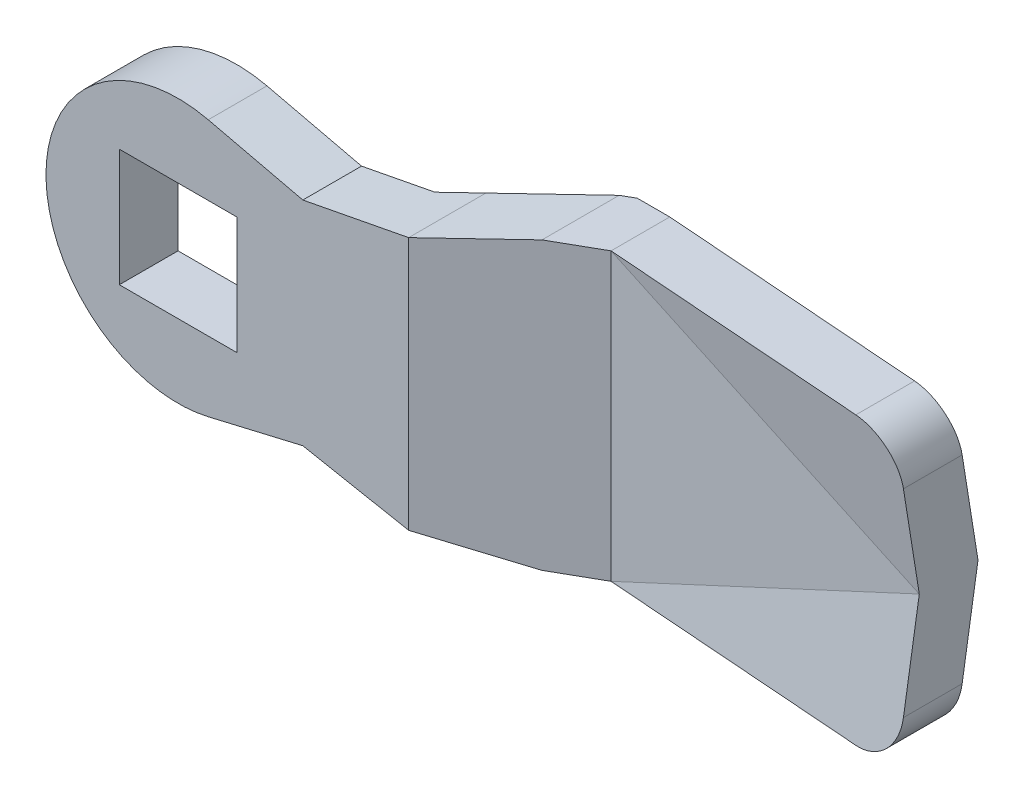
ISO-10303-21;
HEADER;
FILE_DESCRIPTION(('STEP AP214'),'2;1');
FILE_NAME('part.step','',(''),(''),'','','');
FILE_SCHEMA(('AUTOMOTIVE_DESIGN { 1 0 10303 214 1 1 1 1 }'));
ENDSEC;
DATA;
#1=APPLICATION_CONTEXT('core data for automotive mechanical design processes');
#2=APPLICATION_PROTOCOL_DEFINITION('international standard','automotive_design',2000,#1);
#3=PRODUCT_CONTEXT('',#1,'mechanical');
#4=PRODUCT('Part','Part','',(#3));
#5=PRODUCT_RELATED_PRODUCT_CATEGORY('part','',(#4));
#6=PRODUCT_DEFINITION_FORMATION('','',#4);
#7=PRODUCT_DEFINITION_CONTEXT('part definition',#1,'design');
#8=PRODUCT_DEFINITION('design','',#6,#7);
#9=PRODUCT_DEFINITION_SHAPE('','',#8);
#10=(LENGTH_UNIT() NAMED_UNIT(*) SI_UNIT(.MILLI.,.METRE.));
#11=(NAMED_UNIT(*) PLANE_ANGLE_UNIT() SI_UNIT($,.RADIAN.));
#12=(NAMED_UNIT(*) SI_UNIT($,.STERADIAN.) SOLID_ANGLE_UNIT());
#13=UNCERTAINTY_MEASURE_WITH_UNIT(LENGTH_MEASURE(1.E-05),#10,'distance_accuracy_value','');
#14=(GEOMETRIC_REPRESENTATION_CONTEXT(3) GLOBAL_UNCERTAINTY_ASSIGNED_CONTEXT((#13)) GLOBAL_UNIT_ASSIGNED_CONTEXT((#10,
#11,#12)) REPRESENTATION_CONTEXT('',''));
#15=CARTESIAN_POINT('',(0.,0.,0.));
#16=DIRECTION('',(0.,0.,1.));
#17=DIRECTION('',(1.,0.,0.));
#18=AXIS2_PLACEMENT_3D('',#15,#16,#17);
#19=CARTESIAN_POINT('',(36.,0.,-1.));
#20=DIRECTION('',(0.,0.,1.));
#21=DIRECTION('',(1.,0.,0.));
#22=AXIS2_PLACEMENT_3D('',#19,#20,#21);
#23=PLANE('',#22);
#24=CARTESIAN_POINT('',(24.5,9.75000000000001,-0.999999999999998));
#25=DIRECTION('',(0.907008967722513,-0.421111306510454,0.));
#26=VECTOR('',#25,1.);
#27=LINE('',#24,#26);
#28=CARTESIAN_POINT('',(24.5,9.75,-1.));
#29=VERTEX_POINT('',#28);
#30=CARTESIAN_POINT('',(45.4999999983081,0.,-0.999999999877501));
#31=VERTEX_POINT('',#30);
#32=EDGE_CURVE('E1258',#29,#31,#27,.T.);
#33=ORIENTED_EDGE('',*,*,#32,.F.);
#34=CARTESIAN_POINT('',(24.5,-9.75,-0.999999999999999));
#35=DIRECTION('',(0.,1.,0.));
#36=VECTOR('',#35,1.);
#37=LINE('',#34,#36);
#38=CARTESIAN_POINT('',(24.5,-9.75,-1.));
#39=VERTEX_POINT('',#38);
#40=EDGE_CURVE('E329',#39,#29,#37,.T.);
#41=ORIENTED_EDGE('',*,*,#40,.F.);
#42=CARTESIAN_POINT('',(45.4999999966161,0.,-1.));
#43=DIRECTION('',(-0.907008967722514,-0.421111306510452,0.));
#44=VECTOR('',#43,1.);
#45=LINE('',#42,#44);
#46=EDGE_CURVE('E1386',#31,#39,#45,.T.);
#47=ORIENTED_EDGE('',*,*,#46,.F.);
#48=EDGE_LOOP('',(#33,#41,#47));
#49=FACE_BOUND('',#48,.T.);
#50=ADVANCED_FACE('F16',(#49),#23,.T.);
#51=CARTESIAN_POINT('',(39.2716939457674,8.32058902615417,-0.131759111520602));
#52=DIRECTION('',(-0.0731252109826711,-0.157500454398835,0.984807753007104));
#53=DIRECTION('',(-0.907008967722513,0.421111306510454,0.));
#54=AXIS2_PLACEMENT_3D('',#51,#52,#53);
#55=PLANE('',#54);
#56=CARTESIAN_POINT('',(45.5,6.75,0.0795285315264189));
#57=DIRECTION('',(0.,-0.987451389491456,-0.157923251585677));
#58=VECTOR('',#57,1.);
#59=LINE('',#56,#58);
#60=CARTESIAN_POINT('',(45.5,6.75,0.0795285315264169));
#61=VERTEX_POINT('',#60);
#62=EDGE_CURVE('E1334',#61,#31,#59,.T.);
#63=ORIENTED_EDGE('',*,*,#62,.F.);
#64=CARTESIAN_POINT('',(42.51511117,9.75000000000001,0.33768118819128));
#65=CARTESIAN_POINT('',(42.5479097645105,9.74991721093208,0.340103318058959));
#66=CARTESIAN_POINT('',(42.5807137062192,9.74929471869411,0.342434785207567));
#67=CARTESIAN_POINT('',(42.646269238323,9.74697171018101,0.346914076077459));
#68=CARTESIAN_POINT('',(42.6790208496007,9.74527206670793,0.349062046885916));
#69=CARTESIAN_POINT('',(42.7444363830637,9.74079774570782,0.353174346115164));
#70=CARTESIAN_POINT('',(42.7771003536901,9.73802390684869,0.355138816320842));
#71=CARTESIAN_POINT('',(42.8423054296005,9.73140568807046,0.358884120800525));
#72=CARTESIAN_POINT('',(42.8748466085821,9.72756211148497,0.360665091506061));
#73=CARTESIAN_POINT('',(42.9397711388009,9.71880996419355,0.364043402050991));
#74=CARTESIAN_POINT('',(42.9721545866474,9.71390216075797,0.365640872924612));
#75=CARTESIAN_POINT('',(43.0367289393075,9.70302826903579,0.36865218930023));
#76=CARTESIAN_POINT('',(43.0689199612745,9.69706291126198,0.370066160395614));
#77=CARTESIAN_POINT('',(43.1330750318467,9.68408174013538,0.372710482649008));
#78=CARTESIAN_POINT('',(43.1650392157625,9.67706661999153,0.373940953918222));
#79=CARTESIAN_POINT('',(43.2287065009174,9.66199486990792,0.376218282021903));
#80=CARTESIAN_POINT('',(43.2604097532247,9.65393889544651,0.37726525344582));
#81=CARTESIAN_POINT('',(43.3235214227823,9.63679548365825,0.37917558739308));
#82=CARTESIAN_POINT('',(43.3549300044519,9.62770866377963,0.380039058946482));
#83=CARTESIAN_POINT('',(43.4174189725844,9.60851469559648,0.381582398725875));
#84=CARTESIAN_POINT('',(43.4484995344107,9.59840812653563,0.382262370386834));
#85=CARTESIAN_POINT('',(43.5102995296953,9.57718686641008,0.383438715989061));
#86=CARTESIAN_POINT('',(43.5410191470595,9.56607271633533,0.383935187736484));
#87=CARTESIAN_POINT('',(43.6020647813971,9.54284955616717,0.384744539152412));
#88=CARTESIAN_POINT('',(43.6323909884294,9.53074104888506,0.385057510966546));
#89=CARTESIAN_POINT('',(43.6926178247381,9.50554347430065,0.385499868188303));
#90=CARTESIAN_POINT('',(43.7225186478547,9.49245487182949,0.385629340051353));
#91=CARTESIAN_POINT('',(43.7818632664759,9.46531242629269,0.385704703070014));
#92=CARTESIAN_POINT('',(43.8113072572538,9.45125901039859,0.385650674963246));
#93=CARTESIAN_POINT('',(43.8697073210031,9.42220325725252,0.385359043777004));
#94=CARTESIAN_POINT('',(43.8986635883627,9.40720130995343,0.385121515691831));
#95=CARTESIAN_POINT('',(43.9560579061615,9.37626579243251,0.384462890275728));
#96=CARTESIAN_POINT('',(43.9844961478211,9.36033257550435,0.384041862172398));
#97=CARTESIAN_POINT('',(44.0408247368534,9.32755277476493,0.383016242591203));
#98=CARTESIAN_POINT('',(44.0687152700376,9.31070650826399,0.382411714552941));
#99=CARTESIAN_POINT('',(44.1239194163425,9.27611979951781,0.381019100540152));
#100=CARTESIAN_POINT('',(44.1512332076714,9.25837963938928,0.380231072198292));
#101=CARTESIAN_POINT('',(44.2052555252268,9.22202524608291,0.378471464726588));
#102=CARTESIAN_POINT('',(44.2319642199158,9.20341126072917,0.377499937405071));
#103=CARTESIAN_POINT('',(44.2847487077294,9.16533020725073,0.375373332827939));
#104=CARTESIAN_POINT('',(44.3108246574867,9.14586335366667,0.37421830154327));
#105=CARTESIAN_POINT('',(44.3623167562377,9.10609841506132,0.371724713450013));
#106=CARTESIAN_POINT('',(44.3877330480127,9.08580051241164,0.370386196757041));
#107=CARTESIAN_POINT('',(44.4378796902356,9.04439616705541,0.367525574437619));
#108=CARTESIAN_POINT('',(44.4626101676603,9.02328987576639,0.366003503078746));
#109=CARTESIAN_POINT('',(44.5113598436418,8.98029223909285,0.362776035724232));
#110=CARTESIAN_POINT('',(44.5353791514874,8.95840101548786,0.361070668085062));
#111=CARTESIAN_POINT('',(44.5826819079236,8.91385783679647,0.357475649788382));
#112=CARTESIAN_POINT('',(44.6059654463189,8.8912059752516,0.355586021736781));
#113=CARTESIAN_POINT('',(44.6518847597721,8.84505419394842,0.351616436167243));
#114=CARTESIAN_POINT('',(44.6745169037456,8.82155073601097,0.349535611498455));
#115=CARTESIAN_POINT('',(44.7191653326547,8.77363999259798,0.345182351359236));
#116=CARTESIAN_POINT('',(44.7411754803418,8.74922711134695,0.34290855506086));
#117=CARTESIAN_POINT('',(44.7845385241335,8.69950794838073,0.338168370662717));
#118=CARTESIAN_POINT('',(44.8058850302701,8.67419622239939,0.335700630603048));
#119=CARTESIAN_POINT('',(44.8478791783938,8.62269159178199,0.330572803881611));
#120=CARTESIAN_POINT('',(44.8685201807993,8.59649340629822,0.327911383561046));
#121=CARTESIAN_POINT('',(44.9090614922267,8.54322999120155,0.322396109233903));
#122=CARTESIAN_POINT('',(44.9289549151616,8.51615965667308,0.319540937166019));
#123=CARTESIAN_POINT('',(44.9679591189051,8.46116801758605,0.313638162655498));
#124=CARTESIAN_POINT('',(44.9870627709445,8.4332417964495,0.31058925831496));
#125=CARTESIAN_POINT('',(45.0244454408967,8.37655644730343,0.304298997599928));
#126=CARTESIAN_POINT('',(45.0427170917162,8.34779260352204,0.301056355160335));
#127=CARTESIAN_POINT('',(45.0783938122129,8.28945209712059,0.294378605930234));
#128=CARTESIAN_POINT('',(45.09579128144,8.25987093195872,0.290942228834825));
#129=CARTESIAN_POINT('',(45.129677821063,8.19991794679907,0.283876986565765));
#130=CARTESIAN_POINT('',(45.1461590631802,8.1695418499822,0.280246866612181));
#131=CARTESIAN_POINT('',(45.1781715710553,8.1080232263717,0.272794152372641));
#132=CARTESIAN_POINT('',(45.1936947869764,8.07687666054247,0.268970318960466));
#133=CARTESIAN_POINT('',(45.2237499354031,8.01384360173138,0.261130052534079));
#134=CARTESIAN_POINT('',(45.2382736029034,7.98195332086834,0.25711239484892));
#135=CARTESIAN_POINT('',(45.2662889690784,7.91746093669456,0.248884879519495));
#136=CARTESIAN_POINT('',(45.2797721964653,7.88485530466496,0.244673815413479));
#137=CARTESIAN_POINT('',(45.3032082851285,7.82521811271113,0.236875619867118));
#138=CARTESIAN_POINT('',(45.3133554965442,7.79825918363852,0.233315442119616));
#139=CARTESIAN_POINT('',(45.3330237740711,7.74362627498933,0.226031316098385));
#140=CARTESIAN_POINT('',(45.342531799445,7.71594782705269,0.222305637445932));
#141=CARTESIAN_POINT('',(45.3608754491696,7.65988643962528,0.21469086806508));
#142=CARTESIAN_POINT('',(45.3696976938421,7.63149934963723,0.210800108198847));
#143=CARTESIAN_POINT('',(45.3866230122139,7.57403327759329,0.202855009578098));
#144=CARTESIAN_POINT('',(45.3947123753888,7.54495048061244,0.198799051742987));
#145=CARTESIAN_POINT('',(45.4101245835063,7.48610808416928,0.190523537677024));
#146=CARTESIAN_POINT('',(45.4174333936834,7.45634502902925,0.186302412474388));
#147=CARTESIAN_POINT('',(45.4312367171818,7.39615970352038,0.177696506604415));
#148=CARTESIAN_POINT('',(45.4377168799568,7.36573435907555,0.173310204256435));
#149=CARTESIAN_POINT('',(45.449814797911,7.3042446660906,0.164373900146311));
#150=CARTESIAN_POINT('',(45.4554178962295,7.27317764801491,0.15982242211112));
#151=CARTESIAN_POINT('',(45.4657133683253,7.21042753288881,0.150555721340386));
#152=CARTESIAN_POINT('',(45.4703907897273,7.17874219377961,0.145839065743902));
#153=CARTESIAN_POINT('',(45.4787865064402,7.11478117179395,0.136241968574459));
#154=CARTESIAN_POINT('',(45.4824895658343,7.08250369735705,0.131360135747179));
#155=CARTESIAN_POINT('',(45.488888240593,7.0173870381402,0.12143263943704));
#156=CARTESIAN_POINT('',(45.4915683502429,6.98454653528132,0.116385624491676));
#157=CARTESIAN_POINT('',(45.4958729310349,6.91833544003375,0.106127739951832));
#158=CARTESIAN_POINT('',(45.4974816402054,6.88496402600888,0.100915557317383));
#159=CARTESIAN_POINT('',(45.4995959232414,6.81772578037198,0.0903272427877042));
#160=CARTESIAN_POINT('',(45.5000854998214,6.78385864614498,0.0849498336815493));
#161=CARTESIAN_POINT('',(45.5,6.74999999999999,0.0795285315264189));
#162=B_SPLINE_CURVE_WITH_KNOTS('',3,(#64,#65,#66,#67,#68,#69,#70,#71,#72,#73,#74,#75,#76,#77,
#78,#79,#80,#81,#82,#83,#84,#85,#86,#87,#88,#89,#90,#91,#92,#93,#94,#95,#96,#97,#98,#99,#100,
#101,#102,#103,#104,#105,#106,#107,#108,#109,#110,#111,#112,#113,#114,#115,#116,#117,#118,#119,
#120,#121,#122,#123,#124,#125,#126,#127,#128,#129,#130,#131,#132,#133,#134,#135,#136,#137,#138,
#139,#140,#141,#142,#143,#144,#145,#146,#147,#148,#149,#150,#151,#152,#153,#154,#155,#156,#157,
#158,#159,#160,#161),.UNSPECIFIED.,.F.,.F.,(4,2,2,2,2,2,2,2,2,2,2,2,2,2,2,2,2,2,2,2,2,2,2,2,2,2,
2,2,2,2,2,2,2,2,2,2,2,2,2,2,2,2,2,2,2,2,2,2,4),(0.,0.0986595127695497,0.19723918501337,
0.295742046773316,0.394171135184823,0.49252949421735,0.590820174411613,0.689046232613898,
0.787210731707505,0.885316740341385,0.983367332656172,1.08136558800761,1.17931459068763,
1.27721742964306,1.37507719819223,1.47289699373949,1.57067991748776,1.66842907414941,
1.76614757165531,1.86383852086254,1.96150503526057,2.05915023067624,2.15677722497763,
2.25438913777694,2.35198909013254,2.45005588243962,2.54888319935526,2.64847388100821,
2.74883070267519,2.84995637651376,2.95185355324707,3.05452482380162,3.15797272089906,
3.26219972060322,3.36720824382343,3.47300065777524,3.5795792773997,3.66664134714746,
3.75513511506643,3.84506171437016,3.93642222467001,4.02921767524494,4.12344904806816,
4.21911728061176,4.31622326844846,4.41476786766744,4.51475189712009,4.61617614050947,
4.71904134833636),.UNSPECIFIED.);
#163=CARTESIAN_POINT('',(42.51511117,9.75,0.337681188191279));
#164=VERTEX_POINT('',#163);
#165=EDGE_CURVE('E1380',#164,#61,#162,.T.);
#166=ORIENTED_EDGE('',*,*,#165,.F.);
#167=CARTESIAN_POINT('',(24.5,9.75,-1.));
#168=DIRECTION('',(0.997254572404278,0.,0.0740494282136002));
#169=VECTOR('',#168,1.);
#170=LINE('',#167,#169);
#171=EDGE_CURVE('E1373',#29,#164,#170,.T.);
#172=ORIENTED_EDGE('',*,*,#171,.F.);
#173=ORIENTED_EDGE('',*,*,#32,.T.);
#174=EDGE_LOOP('',(#63,#166,#172,#173));
#175=FACE_BOUND('',#174,.T.);
#176=ADVANCED_FACE('F1484',(#175),#55,.T.);
#177=CARTESIAN_POINT('',(39.2716939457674,-8.32058902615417,-0.131759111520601));
#178=DIRECTION('',(-0.0731252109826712,0.157500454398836,0.984807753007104));
#179=DIRECTION('',(0.907008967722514,0.421111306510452,0.));
#180=AXIS2_PLACEMENT_3D('',#177,#178,#179);
#181=PLANE('',#180);
#182=CARTESIAN_POINT('',(45.5,3.91817654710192E-11,-0.999999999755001));
#183=DIRECTION('',(0.,-0.987451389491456,0.157923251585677));
#184=VECTOR('',#183,1.);
#185=LINE('',#182,#184);
#186=CARTESIAN_POINT('',(45.5,-6.75,0.0795285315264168));
#187=VERTEX_POINT('',#186);
#188=EDGE_CURVE('E1327',#31,#187,#185,.T.);
#189=ORIENTED_EDGE('',*,*,#188,.F.);
#190=ORIENTED_EDGE('',*,*,#46,.T.);
#191=CARTESIAN_POINT('',(42.51511117,-9.75,0.33768118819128));
#192=DIRECTION('',(-0.997254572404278,0.,-0.0740494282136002));
#193=VECTOR('',#192,1.);
#194=LINE('',#191,#193);
#195=CARTESIAN_POINT('',(42.51511117,-9.75,0.33768118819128));
#196=VERTEX_POINT('',#195);
#197=EDGE_CURVE('E198',#196,#39,#194,.T.);
#198=ORIENTED_EDGE('',*,*,#197,.F.);
#199=CARTESIAN_POINT('',(45.5,-6.74999999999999,0.0795285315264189));
#200=CARTESIAN_POINT('',(45.5000854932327,-6.78385605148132,0.0849494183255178));
#201=CARTESIAN_POINT('',(45.4995959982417,-6.81772059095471,0.0903264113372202));
#202=CARTESIAN_POINT('',(45.4974820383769,-6.8849541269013,0.100913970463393));
#203=CARTESIAN_POINT('',(45.4958735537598,-6.91832342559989,0.106125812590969));
#204=CARTESIAN_POINT('',(45.4915695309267,-6.98453077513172,0.116383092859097));
#205=CARTESIAN_POINT('',(45.4888897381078,-7.01736964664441,0.121429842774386));
#206=CARTESIAN_POINT('',(45.4824917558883,-7.08248352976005,0.131356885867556));
#207=CARTESIAN_POINT('',(45.4787890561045,-7.11475985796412,0.136238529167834));
#208=CARTESIAN_POINT('',(45.4703940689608,-7.1787190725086,0.145835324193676));
#209=CARTESIAN_POINT('',(45.4657170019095,-7.21040374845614,0.150551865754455));
#210=CARTESIAN_POINT('',(45.4554222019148,-7.27315301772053,0.159818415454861));
#211=CARTESIAN_POINT('',(45.44981940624,-7.30421985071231,0.164369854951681));
#212=CARTESIAN_POINT('',(45.4377220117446,-7.36570964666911,0.173306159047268));
#213=CARTESIAN_POINT('',(45.431242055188,-7.39613527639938,0.177692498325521));
#214=CARTESIAN_POINT('',(45.4174390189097,-7.45632163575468,0.186298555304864));
#215=CARTESIAN_POINT('',(45.4101302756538,-7.4860854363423,0.190519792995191));
#216=CARTESIAN_POINT('',(45.3947180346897,-7.54492977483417,0.19879560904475));
#217=CARTESIAN_POINT('',(45.3866285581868,-7.57401376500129,0.202851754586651));
#218=CARTESIAN_POINT('',(45.369702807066,-7.63148266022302,0.210797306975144));
#219=CARTESIAN_POINT('',(45.360880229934,-7.65987137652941,0.214688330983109));
#220=CARTESIAN_POINT('',(45.342535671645,-7.71593643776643,0.222303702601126));
#221=CARTESIAN_POINT('',(45.333027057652,-7.74361692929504,0.226029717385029));
#222=CARTESIAN_POINT('',(45.3133573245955,-7.7982543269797,0.233314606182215));
#223=CARTESIAN_POINT('',(45.3032092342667,-7.82521569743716,0.236875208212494));
#224=CARTESIAN_POINT('',(45.2797738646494,-7.88485105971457,0.244673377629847));
#225=CARTESIAN_POINT('',(45.2662924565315,-7.91745250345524,0.24888402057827));
#226=CARTESIAN_POINT('',(45.2382806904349,-7.98193740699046,0.257110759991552));
#227=CARTESIAN_POINT('',(45.2237587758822,-8.01382438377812,0.261128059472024));
#228=CARTESIAN_POINT('',(45.1937070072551,-8.07685170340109,0.268967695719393));
#229=CARTESIAN_POINT('',(45.178185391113,-8.10799582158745,0.272791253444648));
#230=CARTESIAN_POINT('',(45.1461758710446,-8.16951038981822,0.280243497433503));
#231=CARTESIAN_POINT('',(45.1296959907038,-8.19988486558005,0.283873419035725));
#232=CARTESIAN_POINT('',(45.095811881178,-8.25983541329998,0.290938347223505));
#233=CARTESIAN_POINT('',(45.0784154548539,-8.28941574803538,0.294374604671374));
#234=CARTESIAN_POINT('',(45.0427404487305,-8.34775535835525,0.301052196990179));
#235=CARTESIAN_POINT('',(45.024469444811,-8.37651912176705,0.304294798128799));
#236=CARTESIAN_POINT('',(44.9870876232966,-8.43320503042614,0.310585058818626));
#237=CARTESIAN_POINT('',(44.9679841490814,-8.46113187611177,0.313634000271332));
#238=CARTESIAN_POINT('',(44.9289797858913,-8.51612543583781,0.319536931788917));
#239=CARTESIAN_POINT('',(44.9090860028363,-8.54319705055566,0.32239221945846));
#240=CARTESIAN_POINT('',(44.8685433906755,-8.59646364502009,0.327907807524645));
#241=CARTESIAN_POINT('',(44.8479014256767,-8.62266371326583,0.330569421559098));
#242=CARTESIAN_POINT('',(44.8059047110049,-8.67417267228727,0.335697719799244));
#243=CARTESIAN_POINT('',(44.784556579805,-8.69948682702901,0.33816573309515));
#244=CARTESIAN_POINT('',(44.7411895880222,-8.74921135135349,0.342906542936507));
#245=CARTESIAN_POINT('',(44.7191770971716,-8.77362714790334,0.345180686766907));
#246=CARTESIAN_POINT('',(44.6745232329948,-8.82154416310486,0.349534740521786));
#247=CARTESIAN_POINT('',(44.6518879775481,-8.84505095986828,0.351616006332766));
#248=CARTESIAN_POINT('',(44.6059662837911,-8.89120513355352,0.355586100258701));
#249=CARTESIAN_POINT('',(44.582683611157,-8.91385617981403,0.357475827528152));
#250=CARTESIAN_POINT('',(44.5353825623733,-8.95839785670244,0.361071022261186));
#251=CARTESIAN_POINT('',(44.5113640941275,-8.98028839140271,0.362776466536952));
#252=CARTESIAN_POINT('',(44.4626160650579,-9.02328477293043,0.366004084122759));
#253=CARTESIAN_POINT('',(44.4378863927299,-9.04439049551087,0.367526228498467));
#254=CARTESIAN_POINT('',(44.3877413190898,-9.08579382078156,0.370386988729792));
#255=CARTESIAN_POINT('',(44.3623257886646,-9.10609126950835,0.371725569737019));
#256=CARTESIAN_POINT('',(44.3108351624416,-9.14585541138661,0.374219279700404));
#257=CARTESIAN_POINT('',(44.2847599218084,-9.16532191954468,0.375374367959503));
#258=CARTESIAN_POINT('',(44.2319767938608,-9.20340238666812,0.377501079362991));
#259=CARTESIAN_POINT('',(44.2052687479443,-9.22201612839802,0.378472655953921));
#260=CARTESIAN_POINT('',(44.1512476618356,-9.25837013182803,0.380232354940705));
#261=CARTESIAN_POINT('',(44.1239344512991,-9.27611014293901,0.381020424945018));
#262=CARTESIAN_POINT('',(44.0687313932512,-9.31069664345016,0.382413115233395));
#263=CARTESIAN_POINT('',(44.0408413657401,-9.32754284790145,0.38301767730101));
#264=CARTESIAN_POINT('',(43.9845137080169,-9.3603226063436,0.384043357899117));
#265=CARTESIAN_POINT('',(43.9560758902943,-9.37625584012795,0.38446441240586));
#266=CARTESIAN_POINT('',(43.8986823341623,-9.40719146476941,0.385123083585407));
#267=CARTESIAN_POINT('',(43.8697264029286,-9.42219349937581,0.385360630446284));
#268=CARTESIAN_POINT('',(43.8113269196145,-9.45124949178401,0.385652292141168));
#269=CARTESIAN_POINT('',(43.7818831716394,-9.46530305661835,0.385706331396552));
#270=CARTESIAN_POINT('',(43.7225389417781,-9.4924458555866,0.385630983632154));
#271=CARTESIAN_POINT('',(43.6926382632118,-9.50553465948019,0.385501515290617));
#272=CARTESIAN_POINT('',(43.6324116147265,-9.53073268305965,0.385059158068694));
#273=CARTESIAN_POINT('',(43.6020854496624,-9.54284143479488,0.384746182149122));
#274=CARTESIAN_POINT('',(43.5410397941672,-9.56606512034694,0.383936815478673));
#275=CARTESIAN_POINT('',(43.510320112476,-9.57717954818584,0.38344033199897));
#276=CARTESIAN_POINT('',(43.4485198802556,-9.59840139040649,0.382263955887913));
#277=CARTESIAN_POINT('',(43.4174391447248,-9.60850826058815,0.38158396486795));
#278=CARTESIAN_POINT('',(43.3549497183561,-9.62770284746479,0.380040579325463));
#279=CARTESIAN_POINT('',(43.3235408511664,-9.63678998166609,0.379177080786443));
#280=CARTESIAN_POINT('',(43.2604284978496,-9.65393402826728,0.377266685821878));
#281=CARTESIAN_POINT('',(43.2287248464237,-9.6619903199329,0.376219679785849));
#282=CARTESIAN_POINT('',(43.1650566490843,-9.6770627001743,0.373942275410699));
#283=CARTESIAN_POINT('',(43.1330919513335,-9.68407812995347,0.372711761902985));
#284=CARTESIAN_POINT('',(43.0689357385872,-9.69705990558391,0.370067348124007));
#285=CARTESIAN_POINT('',(43.0367440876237,-9.70302555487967,0.368653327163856));
#286=CARTESIAN_POINT('',(42.9721683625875,-9.71390000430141,0.365641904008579));
#287=CARTESIAN_POINT('',(42.939784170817,-9.71880807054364,0.364044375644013));
#288=CARTESIAN_POINT('',(42.8748580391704,-9.72756070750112,0.36066594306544));
#289=CARTESIAN_POINT('',(42.8423160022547,-9.73140450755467,0.35888490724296));
#290=CARTESIAN_POINT('',(42.7771090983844,-9.73802312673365,0.355139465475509));
#291=CARTESIAN_POINT('',(42.7444441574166,-9.74079713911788,0.353174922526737));
#292=CARTESIAN_POINT('',(42.6790265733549,-9.74527175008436,0.34906247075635));
#293=CARTESIAN_POINT('',(42.6462738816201,-9.74697150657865,0.346914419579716));
#294=CARTESIAN_POINT('',(42.5807160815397,-9.74929467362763,0.342434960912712));
#295=CARTESIAN_POINT('',(42.547910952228,-9.74991720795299,0.340103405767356));
#296=CARTESIAN_POINT('',(42.51511117,-9.74999999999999,0.33768118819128));
#297=B_SPLINE_CURVE_WITH_KNOTS('',3,(#199,#200,#201,#202,#203,#204,#205,#206,#207,#208,#209,
#210,#211,#212,#213,#214,#215,#216,#217,#218,#219,#220,#221,#222,#223,#224,#225,#226,#227,#228,
#229,#230,#231,#232,#233,#234,#235,#236,#237,#238,#239,#240,#241,#242,#243,#244,#245,#246,#247,
#248,#249,#250,#251,#252,#253,#254,#255,#256,#257,#258,#259,#260,#261,#262,#263,#264,#265,#266,
#267,#268,#269,#270,#271,#272,#273,#274,#275,#276,#277,#278,#279,#280,#281,#282,#283,#284,#285,
#286,#287,#288,#289,#290,#291,#292,#293,#294,#295,#296),.UNSPECIFIED.,.F.,.F.,(4,2,2,2,2,2,2,2,
2,2,2,2,2,2,2,2,2,2,2,2,2,2,2,2,2,2,2,2,2,2,2,2,2,2,2,2,2,2,2,2,2,2,2,2,2,2,2,2,4),(0.,
0.102857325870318,0.20427512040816,0.304254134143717,0.402795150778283,0.499898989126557,
0.595566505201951,0.689798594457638,0.782596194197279,0.873960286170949,0.963891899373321,
1.05239211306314,1.13946206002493,1.24602693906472,1.35180810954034,1.45680788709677,
1.56102863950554,1.66447278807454,1.76714280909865,1.86904123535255,1.9701706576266,
2.07053372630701,2.17013315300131,2.26897171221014,2.36705224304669,2.46464865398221,
2.56225733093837,2.65988139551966,2.75752396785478,2.85518816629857,2.95287710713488,
3.05059390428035,3.14834166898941,3.24612350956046,3.34394253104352,3.44180183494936,
3.53970451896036,3.63765367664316,3.73565239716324,3.83370376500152,3.93181085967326,
4.02997675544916,4.12820452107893,4.22649721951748,4.32485790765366,4.42328963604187,
4.52179544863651,4.62037838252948,4.7190414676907),.UNSPECIFIED.);
#298=EDGE_CURVE('E1354',#187,#196,#297,.T.);
#299=ORIENTED_EDGE('',*,*,#298,.F.);
#300=EDGE_LOOP('',(#189,#190,#198,#299));
#301=FACE_BOUND('',#300,.T.);
#302=ADVANCED_FACE('F1496',(#301),#181,.T.);
#303=CARTESIAN_POINT('',(42.5075364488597,6.75753654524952,-10.));
#304=DIRECTION('',(0.,0.,1.));
#305=DIRECTION('',(0.999996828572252,-0.00251850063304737,0.));
#306=AXIS2_PLACEMENT_3D('',#303,#304,#305);
#307=CYLINDRICAL_SURFACE('',#306,2.99247304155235);
#308=ORIENTED_EDGE('',*,*,#165,.T.);
#309=CARTESIAN_POINT('',(45.5,6.75,-3.92047146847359));
#310=DIRECTION('',(0.,0.,1.));
#311=VECTOR('',#310,1.);
#312=LINE('',#309,#311);
#313=CARTESIAN_POINT('',(45.5,6.75,-3.92047146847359));
#314=VERTEX_POINT('',#313);
#315=EDGE_CURVE('E1341',#314,#61,#312,.T.);
#316=ORIENTED_EDGE('',*,*,#315,.F.);
#317=CARTESIAN_POINT('',(45.5,6.74999999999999,-3.92047146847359));
#318=CARTESIAN_POINT('',(45.5000854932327,6.78385605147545,-3.91505058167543));
#319=CARTESIAN_POINT('',(45.4995959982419,6.81772059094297,-3.90967358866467));
#320=CARTESIAN_POINT('',(45.4974820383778,6.88495412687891,-3.89908602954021));
#321=CARTESIAN_POINT('',(45.4958735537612,6.91832342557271,-3.8938741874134));
#322=CARTESIAN_POINT('',(45.4915695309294,6.98453077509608,-3.88361690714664));
#323=CARTESIAN_POINT('',(45.4888897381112,7.01736964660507,-3.87857015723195));
#324=CARTESIAN_POINT('',(45.4824917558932,7.08248352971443,-3.86864311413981));
#325=CARTESIAN_POINT('',(45.4787890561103,7.11475985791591,-3.86376147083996));
#326=CARTESIAN_POINT('',(45.4703940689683,7.1787190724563,-3.8541646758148));
#327=CARTESIAN_POINT('',(45.4657170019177,7.21040374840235,-3.84944813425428));
#328=CARTESIAN_POINT('',(45.4554222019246,7.27315301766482,-3.84018158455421));
#329=CARTESIAN_POINT('',(45.4498194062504,7.30421985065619,-3.83563014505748));
#330=CARTESIAN_POINT('',(45.4377220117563,7.36570964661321,-3.82669384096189));
#331=CARTESIAN_POINT('',(45.4312420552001,7.39613527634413,-3.82230750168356));
#332=CARTESIAN_POINT('',(45.4174390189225,7.45632163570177,-3.81370144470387));
#333=CARTESIAN_POINT('',(45.4101302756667,7.48608543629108,-3.80948020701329));
#334=CARTESIAN_POINT('',(45.3947180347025,7.54492977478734,-3.80120439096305));
#335=CARTESIAN_POINT('',(45.3866285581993,7.57401376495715,-3.79714824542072));
#336=CARTESIAN_POINT('',(45.3697028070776,7.63148266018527,-3.7892026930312));
#337=CARTESIAN_POINT('',(45.3608802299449,7.65987137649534,-3.78531166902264));
#338=CARTESIAN_POINT('',(45.3425356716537,7.71593643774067,-3.77769629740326));
#339=CARTESIAN_POINT('',(45.3330270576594,7.7436169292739,-3.7739702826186));
#340=CARTESIAN_POINT('',(45.3133573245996,7.79825432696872,-3.76668539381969));
#341=CARTESIAN_POINT('',(45.3032092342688,7.8252156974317,-3.76312479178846));
#342=CARTESIAN_POINT('',(45.2797738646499,7.88485105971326,-3.75532662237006));
#343=CARTESIAN_POINT('',(45.2662924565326,7.91745250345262,-3.75111597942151));
#344=CARTESIAN_POINT('',(45.2382806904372,7.98193740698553,-3.74288924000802));
#345=CARTESIAN_POINT('',(45.223758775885,8.01382438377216,-3.73887194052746));
#346=CARTESIAN_POINT('',(45.1937070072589,8.07685170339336,-3.73103230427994));
#347=CARTESIAN_POINT('',(45.1781853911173,8.10799582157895,-3.72720874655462));
#348=CARTESIAN_POINT('',(45.1461758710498,8.16951038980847,-3.71975650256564));
#349=CARTESIAN_POINT('',(45.1296959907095,8.1998848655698,-3.71612658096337));
#350=CARTESIAN_POINT('',(45.0958118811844,8.25983541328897,-3.70906165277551));
#351=CARTESIAN_POINT('',(45.0784154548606,8.28941574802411,-3.70562539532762));
#352=CARTESIAN_POINT('',(45.0427404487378,8.3477553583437,-3.69894780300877));
#353=CARTESIAN_POINT('',(45.0244694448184,8.37651912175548,-3.69570520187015));
#354=CARTESIAN_POINT('',(44.9870876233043,8.43320503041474,-3.68941494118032));
#355=CARTESIAN_POINT('',(44.9679841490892,8.46113187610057,-3.68636599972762));
#356=CARTESIAN_POINT('',(44.928979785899,8.51612543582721,-3.68046306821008));
#357=CARTESIAN_POINT('',(44.9090860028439,8.54319705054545,-3.67760778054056));
#358=CARTESIAN_POINT('',(44.8685433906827,8.59646364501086,-3.67209219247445));
#359=CARTESIAN_POINT('',(44.8479014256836,8.62266371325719,-3.66943057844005));
#360=CARTESIAN_POINT('',(44.805904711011,8.67417267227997,-3.66430228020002));
#361=CARTESIAN_POINT('',(44.7845565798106,8.69948682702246,-3.66183426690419));
#362=CARTESIAN_POINT('',(44.7411895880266,8.74921135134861,-3.65709345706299));
#363=CARTESIAN_POINT('',(44.7191770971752,8.77362714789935,-3.65481931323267));
#364=CARTESIAN_POINT('',(44.6745232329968,8.82154416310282,-3.65046525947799));
#365=CARTESIAN_POINT('',(44.6518879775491,8.84505095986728,-3.64838399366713));
#366=CARTESIAN_POINT('',(44.60596628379,8.89120513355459,-3.64441389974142));
#367=CARTESIAN_POINT('',(44.5826836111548,8.91385617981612,-3.64252417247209));
#368=CARTESIAN_POINT('',(44.535382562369,8.95839785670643,-3.63892897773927));
#369=CARTESIAN_POINT('',(44.5113640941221,8.98028839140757,-3.6372235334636));
#370=CARTESIAN_POINT('',(44.4626160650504,9.02328477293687,-3.63399591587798));
#371=CARTESIAN_POINT('',(44.4378863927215,9.04439049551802,-3.63247377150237));
#372=CARTESIAN_POINT('',(44.3877413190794,9.08579382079,-3.62961301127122));
#373=CARTESIAN_POINT('',(44.3623257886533,9.10609126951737,-3.62827443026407));
#374=CARTESIAN_POINT('',(44.3108351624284,9.14585541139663,-3.62578072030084));
#375=CARTESIAN_POINT('',(44.2847599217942,9.16532191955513,-3.62462563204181));
#376=CARTESIAN_POINT('',(44.2319767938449,9.20340238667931,-3.62249892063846));
#377=CARTESIAN_POINT('',(44.2052687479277,9.22201612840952,-3.62152734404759));
#378=CARTESIAN_POINT('',(44.1512476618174,9.25837013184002,-3.61976764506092));
#379=CARTESIAN_POINT('',(44.1239344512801,9.27611014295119,-3.61897957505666));
#380=CARTESIAN_POINT('',(44.0687313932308,9.3106966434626,-3.61758688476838));
#381=CARTESIAN_POINT('',(44.0408413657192,9.32754284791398,-3.61698232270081));
#382=CARTESIAN_POINT('',(43.9845137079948,9.36032260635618,-3.61595664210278));
#383=CARTESIAN_POINT('',(43.9560758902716,9.37625584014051,-3.61553558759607));
#384=CARTESIAN_POINT('',(43.8986823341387,9.40719146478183,-3.61487691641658));
#385=CARTESIAN_POINT('',(43.8697264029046,9.42219349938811,-3.61463936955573));
#386=CARTESIAN_POINT('',(43.8113269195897,9.45124949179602,-3.61434770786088));
#387=CARTESIAN_POINT('',(43.7818831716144,9.46530305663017,-3.61429366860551));
#388=CARTESIAN_POINT('',(43.7225389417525,9.49244585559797,-3.61436901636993));
#389=CARTESIAN_POINT('',(43.6926382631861,9.50553465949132,-3.61449848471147));
#390=CARTESIAN_POINT('',(43.6324116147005,9.53073268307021,-3.61494084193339));
#391=CARTESIAN_POINT('',(43.6020854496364,9.54284143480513,-3.61525381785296));
#392=CARTESIAN_POINT('',(43.5410397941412,9.56606512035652,-3.61606318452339));
#393=CARTESIAN_POINT('',(43.5103201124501,9.57717954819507,-3.61655966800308));
#394=CARTESIAN_POINT('',(43.44851988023,9.59840139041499,-3.6177360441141));
#395=CARTESIAN_POINT('',(43.4174391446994,9.60850826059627,-3.61841603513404));
#396=CARTESIAN_POINT('',(43.3549497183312,9.62770284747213,-3.61995942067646));
#397=CARTESIAN_POINT('',(43.3235408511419,9.63678998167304,-3.62082291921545));
#398=CARTESIAN_POINT('',(43.260428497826,9.65393402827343,-3.62273331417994));
#399=CARTESIAN_POINT('',(43.2287248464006,9.66199031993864,-3.62378032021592));
#400=CARTESIAN_POINT('',(43.1650566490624,9.67706270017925,-3.62605772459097));
#401=CARTESIAN_POINT('',(43.1330919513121,9.68407812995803,-3.62728823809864));
#402=CARTESIAN_POINT('',(43.0689357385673,9.69705990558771,-3.6299326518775));
#403=CARTESIAN_POINT('',(43.0367440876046,9.7030255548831,-3.63134667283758));
#404=CARTESIAN_POINT('',(42.9721683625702,9.71390000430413,-3.63435809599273));
#405=CARTESIAN_POINT('',(42.9397841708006,9.71880807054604,-3.63595562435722));
#406=CARTESIAN_POINT('',(42.874858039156,9.7275607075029,-3.63933405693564));
#407=CARTESIAN_POINT('',(42.8423160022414,9.73140450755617,-3.64111509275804));
#408=CARTESIAN_POINT('',(42.7771090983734,9.73802312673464,-3.64486053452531));
#409=CARTESIAN_POINT('',(42.7444441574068,9.74079713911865,-3.64682507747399));
#410=CARTESIAN_POINT('',(42.6790265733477,9.74527175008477,-3.65093752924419));
#411=CARTESIAN_POINT('',(42.6462738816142,9.74697150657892,-3.65308558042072));
#412=CARTESIAN_POINT('',(42.5807160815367,9.74929467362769,-3.65756503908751));
#413=CARTESIAN_POINT('',(42.5479109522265,9.749917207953,-3.65989659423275));
#414=CARTESIAN_POINT('',(42.51511117,9.75000000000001,-3.66231881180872));
#415=B_SPLINE_CURVE_WITH_KNOTS('',3,(#317,#318,#319,#320,#321,#322,#323,#324,#325,#326,#327,
#328,#329,#330,#331,#332,#333,#334,#335,#336,#337,#338,#339,#340,#341,#342,#343,#344,#345,#346,
#347,#348,#349,#350,#351,#352,#353,#354,#355,#356,#357,#358,#359,#360,#361,#362,#363,#364,#365,
#366,#367,#368,#369,#370,#371,#372,#373,#374,#375,#376,#377,#378,#379,#380,#381,#382,#383,#384,
#385,#386,#387,#388,#389,#390,#391,#392,#393,#394,#395,#396,#397,#398,#399,#400,#401,#402,#403,
#404,#405,#406,#407,#408,#409,#410,#411,#412,#413,#414),.UNSPECIFIED.,.F.,.F.,(4,2,2,2,2,2,2,2,
2,2,2,2,2,2,2,2,2,2,2,2,2,2,2,2,2,2,2,2,2,2,2,2,2,2,2,2,2,2,2,2,2,2,2,2,2,2,2,2,4),(0.,
0.10285732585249,0.204275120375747,0.304254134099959,0.402795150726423,0.499898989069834,
0.595566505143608,0.689798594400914,0.782596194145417,0.873960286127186,0.963891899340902,
1.0523921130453,1.13946206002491,1.24602693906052,1.35180810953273,1.45680788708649,
1.56102863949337,1.66447278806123,1.76714280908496,1.86904123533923,1.97017065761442,
2.07053372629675,2.17013315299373,2.268971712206,2.36705224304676,2.46464865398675,
2.56225733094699,2.65988139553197,2.7575239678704,2.85518816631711,2.95287710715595,
3.05059390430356,3.14834166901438,3.2461235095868,3.34394253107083,3.44180183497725,
3.53970451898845,3.63765367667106,3.73565239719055,3.83370376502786,3.93181085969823,
4.02997675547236,4.12820452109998,4.22649721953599,4.32485790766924,4.42328963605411,
4.52179544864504,4.6203783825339,4.71904146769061),.UNSPECIFIED.);
#416=CARTESIAN_POINT('',(42.51511117,9.75,-3.66231881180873));
#417=VERTEX_POINT('',#416);
#418=EDGE_CURVE('E1314',#314,#417,#415,.T.);
#419=ORIENTED_EDGE('',*,*,#418,.T.);
#420=CARTESIAN_POINT('',(42.51511117,9.75,0.33768118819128));
#421=DIRECTION('',(0.,0.,-1.));
#422=VECTOR('',#421,1.);
#423=LINE('',#420,#422);
#424=EDGE_CURVE('E1366',#164,#417,#423,.T.);
#425=ORIENTED_EDGE('',*,*,#424,.F.);
#426=EDGE_LOOP('',(#308,#316,#419,#425));
#427=FACE_BOUND('',#426,.T.);
#428=ADVANCED_FACE('F1507',(#427),#307,.T.);
#429=CARTESIAN_POINT('',(33.507555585,9.75,-10.));
#430=DIRECTION('',(0.,1.,0.));
#431=DIRECTION('',(1.,0.,0.));
#432=AXIS2_PLACEMENT_3D('',#429,#430,#431);
#433=PLANE('',#432);
#434=ORIENTED_EDGE('',*,*,#171,.T.);
#435=ORIENTED_EDGE('',*,*,#424,.T.);
#436=CARTESIAN_POINT('',(42.51511117,9.75,-3.66231881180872));
#437=DIRECTION('',(-0.997254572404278,0.,-0.0740494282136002));
#438=VECTOR('',#437,1.);
#439=LINE('',#436,#438);
#440=CARTESIAN_POINT('',(24.5,9.75,-5.));
#441=VERTEX_POINT('',#440);
#442=EDGE_CURVE('E1307',#417,#441,#439,.T.);
#443=ORIENTED_EDGE('',*,*,#442,.T.);
#444=CARTESIAN_POINT('',(24.5,9.75,-5.));
#445=DIRECTION('',(0.,0.,1.));
#446=VECTOR('',#445,1.);
#447=LINE('',#444,#446);
#448=EDGE_CURVE('E619',#441,#29,#447,.T.);
#449=ORIENTED_EDGE('',*,*,#448,.T.);
#450=EDGE_LOOP('',(#434,#435,#443,#449));
#451=FACE_BOUND('',#450,.T.);
#452=ADVANCED_FACE('F1519',(#451),#433,.T.);
#453=CARTESIAN_POINT('',(33.507555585,-9.75,-10.));
#454=DIRECTION('',(0.,-1.,0.));
#455=DIRECTION('',(0.,0.,-1.));
#456=AXIS2_PLACEMENT_3D('',#453,#454,#455);
#457=PLANE('',#456);
#458=ORIENTED_EDGE('',*,*,#197,.T.);
#459=CARTESIAN_POINT('',(24.5,-9.75,-1.));
#460=DIRECTION('',(0.,0.,-1.));
#461=VECTOR('',#460,1.);
#462=LINE('',#459,#461);
#463=CARTESIAN_POINT('',(24.5,-9.75,-5.));
#464=VERTEX_POINT('',#463);
#465=EDGE_CURVE('E189',#39,#464,#462,.T.);
#466=ORIENTED_EDGE('',*,*,#465,.T.);
#467=CARTESIAN_POINT('',(24.5,-9.75,-5.));
#468=DIRECTION('',(0.997254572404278,0.,0.0740494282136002));
#469=VECTOR('',#468,1.);
#470=LINE('',#467,#469);
#471=CARTESIAN_POINT('',(42.51511117,-9.75,-3.66231881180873));
#472=VERTEX_POINT('',#471);
#473=EDGE_CURVE('E195',#464,#472,#470,.T.);
#474=ORIENTED_EDGE('',*,*,#473,.T.);
#475=CARTESIAN_POINT('',(42.51511117,-9.74999999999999,0.33768118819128));
#476=DIRECTION('',(0.,0.,-1.));
#477=VECTOR('',#476,1.);
#478=LINE('',#475,#477);
#479=EDGE_CURVE('E1348',#196,#472,#478,.T.);
#480=ORIENTED_EDGE('',*,*,#479,.F.);
#481=EDGE_LOOP('',(#458,#466,#474,#480));
#482=FACE_BOUND('',#481,.T.);
#483=ADVANCED_FACE('F192',(#482),#457,.T.);
#484=CARTESIAN_POINT('',(42.5075364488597,-6.75753654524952,-10.));
#485=DIRECTION('',(0.,0.,1.));
#486=DIRECTION('',(0.00253125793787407,-0.999996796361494,0.));
#487=AXIS2_PLACEMENT_3D('',#484,#485,#486);
#488=CYLINDRICAL_SURFACE('',#487,2.99247304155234);
#489=ORIENTED_EDGE('',*,*,#298,.T.);
#490=ORIENTED_EDGE('',*,*,#479,.T.);
#491=CARTESIAN_POINT('',(42.51511117,-9.74999999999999,-3.66231881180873));
#492=CARTESIAN_POINT('',(42.547909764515,-9.74991721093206,-3.65989668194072));
#493=CARTESIAN_POINT('',(42.5807137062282,-9.74929471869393,-3.65756521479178));
#494=CARTESIAN_POINT('',(42.6462692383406,-9.74697171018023,-3.65308592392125));
#495=CARTESIAN_POINT('',(42.6790208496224,-9.74527206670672,-3.65093795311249));
#496=CARTESIAN_POINT('',(42.7444363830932,-9.74079774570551,-3.64682565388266));
#497=CARTESIAN_POINT('',(42.7771003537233,-9.73802390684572,-3.64486118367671));
#498=CARTESIAN_POINT('',(42.8423054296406,-9.73140568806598,-3.64111587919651));
#499=CARTESIAN_POINT('',(42.8748466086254,-9.72756211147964,-3.63933490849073));
#500=CARTESIAN_POINT('',(42.9397711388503,-9.71880996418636,-3.63595659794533));
#501=CARTESIAN_POINT('',(42.9721545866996,-9.71390216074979,-3.63435912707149));
#502=CARTESIAN_POINT('',(43.0367289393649,-9.70302826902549,-3.63134781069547));
#503=CARTESIAN_POINT('',(43.0689199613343,-9.69706291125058,-3.6299338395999));
#504=CARTESIAN_POINT('',(43.1330750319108,-9.68408174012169,-3.62728951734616));
#505=CARTESIAN_POINT('',(43.1650392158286,-9.67706661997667,-3.62605904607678));
#506=CARTESIAN_POINT('',(43.2287065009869,-9.66199486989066,-3.62378171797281));
#507=CARTESIAN_POINT('',(43.2604097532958,-9.65393889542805,-3.62273474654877));
#508=CARTESIAN_POINT('',(43.3235214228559,-9.63679548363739,-3.62082441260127));
#509=CARTESIAN_POINT('',(43.3549300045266,-9.62770866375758,-3.61996094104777));
#510=CARTESIAN_POINT('',(43.4174189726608,-9.60851469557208,-3.6184176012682));
#511=CARTESIAN_POINT('',(43.4484995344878,-9.59840812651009,-3.61773762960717));
#512=CARTESIAN_POINT('',(43.5102995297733,-9.57718686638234,-3.61656128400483));
#513=CARTESIAN_POINT('',(43.5410191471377,-9.56607271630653,-3.61606481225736));
#514=CARTESIAN_POINT('',(43.6020647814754,-9.54284955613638,-3.61525546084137));
#515=CARTESIAN_POINT('',(43.6323909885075,-9.53074104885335,-3.61494248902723));
#516=CARTESIAN_POINT('',(43.6926178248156,-9.50554347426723,-3.61450013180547));
#517=CARTESIAN_POINT('',(43.7225186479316,-9.49245487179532,-3.61437065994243));
#518=CARTESIAN_POINT('',(43.7818632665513,-9.46531242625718,-3.61429529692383));
#519=CARTESIAN_POINT('',(43.8113072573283,-9.4512590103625,-3.61434932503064));
#520=CARTESIAN_POINT('',(43.8697073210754,-9.42220325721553,-3.614640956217));
#521=CARTESIAN_POINT('',(43.8986635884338,-9.40720130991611,-3.61487848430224));
#522=CARTESIAN_POINT('',(43.9560579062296,-9.37626579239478,-3.61553710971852));
#523=CARTESIAN_POINT('',(43.9844961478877,-9.36033257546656,-3.61595813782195));
#524=CARTESIAN_POINT('',(44.0408247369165,-9.3275527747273,-3.61698375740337));
#525=CARTESIAN_POINT('',(44.0687152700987,-9.31070650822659,-3.61758828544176));
#526=CARTESIAN_POINT('',(44.1239194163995,-9.2761197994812,-3.61898089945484));
#527=CARTESIAN_POINT('',(44.1512332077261,-9.25837963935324,-3.61976892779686));
#528=CARTESIAN_POINT('',(44.2052555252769,-9.22202524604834,-3.62152853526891));
#529=CARTESIAN_POINT('',(44.2319642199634,-9.20341126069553,-3.62250006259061));
#530=CARTESIAN_POINT('',(44.2847487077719,-9.16533020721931,-3.62462666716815));
#531=CARTESIAN_POINT('',(44.3108246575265,-9.14586335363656,-3.62578169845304));
#532=CARTESIAN_POINT('',(44.362316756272,-9.10609841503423,-3.62827528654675));
#533=CARTESIAN_POINT('',(44.387733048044,-9.08580051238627,-3.62961380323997));
#534=CARTESIAN_POINT('',(44.437879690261,-9.0443961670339,-3.63247442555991));
#535=CARTESIAN_POINT('',(44.4626101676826,-9.02328987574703,-3.63399649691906));
#536=CARTESIAN_POINT('',(44.5113598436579,-8.98029223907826,-3.63722396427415));
#537=CARTESIAN_POINT('',(44.5353791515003,-8.95840101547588,-3.63892933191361));
#538=CARTESIAN_POINT('',(44.58268190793,-8.91385783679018,-3.64252435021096));
#539=CARTESIAN_POINT('',(44.605965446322,-8.8912059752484,-3.64441397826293));
#540=CARTESIAN_POINT('',(44.6518847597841,-8.84505419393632,-3.64838356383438));
#541=CARTESIAN_POINT('',(44.6745169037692,-8.82155073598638,-3.65046438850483));
#542=CARTESIAN_POINT('',(44.7191653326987,-8.77363999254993,-3.65481764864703));
#543=CARTESIAN_POINT('',(44.7411754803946,-8.749227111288,-3.65709144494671));
#544=CARTESIAN_POINT('',(44.784538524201,-8.69950794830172,-3.6618316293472));
#545=CARTESIAN_POINT('',(44.8058850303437,-8.6741962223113,-3.66429936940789));
#546=CARTESIAN_POINT('',(44.847879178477,-8.62269159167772,-3.6694271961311));
#547=CARTESIAN_POINT('',(44.8685201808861,-8.59649340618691,-3.6720886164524));
#548=CARTESIAN_POINT('',(44.9090614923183,-8.54322999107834,-3.67760389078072));
#549=CARTESIAN_POINT('',(44.9289549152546,-8.51615965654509,-3.68045906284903));
#550=CARTESIAN_POINT('',(44.9679591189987,-8.46116801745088,-3.68636183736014));
#551=CARTESIAN_POINT('',(44.9870627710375,-8.43324179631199,-3.68941074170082));
#552=CARTESIAN_POINT('',(45.0244454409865,-8.37655644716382,-3.69570100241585));
#553=CARTESIAN_POINT('',(45.0427170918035,-8.34779260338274,-3.69894364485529));
#554=CARTESIAN_POINT('',(45.0783938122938,-8.28945209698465,-3.7056213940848));
#555=CARTESIAN_POINT('',(45.095791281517,-8.25987093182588,-3.70905777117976));
#556=CARTESIAN_POINT('',(45.1296778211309,-8.19991794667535,-3.71612301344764));
#557=CARTESIAN_POINT('',(45.1461590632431,-8.16954184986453,-3.71975313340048));
#558=CARTESIAN_POINT('',(45.178171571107,-8.1080232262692,-3.72720584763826));
#559=CARTESIAN_POINT('',(45.1936947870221,-8.07687666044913,-3.7310296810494));
#560=CARTESIAN_POINT('',(45.2237499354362,-8.0138436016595,-3.73886994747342));
#561=CARTESIAN_POINT('',(45.2382736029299,-7.98195332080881,-3.74288760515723));
#562=CARTESIAN_POINT('',(45.2662889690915,-7.91746093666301,-3.75111512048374));
#563=CARTESIAN_POINT('',(45.2797721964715,-7.88485530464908,-3.75532618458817));
#564=CARTESIAN_POINT('',(45.303208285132,-7.82521811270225,-3.7631243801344));
#565=CARTESIAN_POINT('',(45.313355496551,-7.79825918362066,-3.76668455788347));
#566=CARTESIAN_POINT('',(45.3330237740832,-7.74362627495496,-3.7739686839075));
#567=CARTESIAN_POINT('',(45.3425317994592,-7.71594782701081,-3.77769436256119));
#568=CARTESIAN_POINT('',(45.3608754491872,-7.65988643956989,-3.78530913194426));
#569=CARTESIAN_POINT('',(45.3696976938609,-7.63149934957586,-3.78919989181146));
#570=CARTESIAN_POINT('',(45.3866230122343,-7.57403327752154,-3.79714499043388));
#571=CARTESIAN_POINT('',(45.3947123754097,-7.54495048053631,-3.80120094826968));
#572=CARTESIAN_POINT('',(45.4101245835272,-7.486108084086,-3.80947646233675));
#573=CARTESIAN_POINT('',(45.4174333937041,-7.45634502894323,-3.8136975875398));
#574=CARTESIAN_POINT('',(45.4312367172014,-7.39615970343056,-3.82230349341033));
#575=CARTESIAN_POINT('',(45.4377168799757,-7.36573435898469,-3.82668979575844));
#576=CARTESIAN_POINT('',(45.4498147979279,-7.30424466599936,-3.83562609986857));
#577=CARTESIAN_POINT('',(45.4554178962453,-7.27317764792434,-3.84017757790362));
#578=CARTESIAN_POINT('',(45.4657133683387,-7.21042753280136,-3.8494442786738));
#579=CARTESIAN_POINT('',(45.4703907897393,-7.1787421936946,-3.85416093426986));
#580=CARTESIAN_POINT('',(45.4787865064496,-7.11478117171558,-3.86375803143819));
#581=CARTESIAN_POINT('',(45.4824895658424,-7.0825036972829,-3.86863986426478));
#582=CARTESIAN_POINT('',(45.4888882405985,-7.01738703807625,-3.87856736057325));
#583=CARTESIAN_POINT('',(45.4915683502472,-6.98454653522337,-3.88361437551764));
#584=CARTESIAN_POINT('',(45.4958729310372,-6.91833543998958,-3.89387226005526));
#585=CARTESIAN_POINT('',(45.4974816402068,-6.88496402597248,-3.89908444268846));
#586=CARTESIAN_POINT('',(45.4995959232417,-6.8177257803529,-3.90967275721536));
#587=CARTESIAN_POINT('',(45.5000854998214,-6.78385864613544,-3.91505016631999));
#588=CARTESIAN_POINT('',(45.5,-6.74999999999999,-3.92047146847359));
#589=B_SPLINE_CURVE_WITH_KNOTS('',3,(#491,#492,#493,#494,#495,#496,#497,#498,#499,#500,#501,
#502,#503,#504,#505,#506,#507,#508,#509,#510,#511,#512,#513,#514,#515,#516,#517,#518,#519,#520,
#521,#522,#523,#524,#525,#526,#527,#528,#529,#530,#531,#532,#533,#534,#535,#536,#537,#538,#539,
#540,#541,#542,#543,#544,#545,#546,#547,#548,#549,#550,#551,#552,#553,#554,#555,#556,#557,#558,
#559,#560,#561,#562,#563,#564,#565,#566,#567,#568,#569,#570,#571,#572,#573,#574,#575,#576,#577,
#578,#579,#580,#581,#582,#583,#584,#585,#586,#587,#588),.UNSPECIFIED.,.F.,.F.,(4,2,2,2,2,2,2,2,
2,2,2,2,2,2,2,2,2,2,2,2,2,2,2,2,2,2,2,2,2,2,2,2,2,2,2,2,2,2,2,2,2,2,2,2,2,2,2,2,4),(0.,
0.0986595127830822,0.197239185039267,0.29574204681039,0.394171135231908,0.49252949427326,
0.590820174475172,0.689046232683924,0.787210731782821,0.885316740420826,0.983367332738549,
1.08136558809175,1.17931459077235,1.27721742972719,1.37507719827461,1.47289699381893,
1.5706799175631,1.66842907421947,1.76614757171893,1.86383852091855,1.9615050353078,
2.05915023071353,2.15677722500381,2.25438913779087,2.35198909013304,2.45005588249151,
2.54888319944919,2.64847388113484,2.74883070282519,2.84995637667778,2.95185355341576,
3.05452482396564,3.15797272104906,3.26219972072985,3.36720824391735,3.47300065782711,
3.57957927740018,3.6666413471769,3.75513511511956,3.84506171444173,3.93642222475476,
4.02921767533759,4.12344904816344,4.21911728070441,4.31622326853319,4.414767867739,
4.51475189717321,4.61617614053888,4.71904134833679),.UNSPECIFIED.);
#590=CARTESIAN_POINT('',(45.5,-6.75,-3.92047146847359));
#591=VERTEX_POINT('',#590);
#592=EDGE_CURVE('E230',#472,#591,#589,.T.);
#593=ORIENTED_EDGE('',*,*,#592,.T.);
#594=CARTESIAN_POINT('',(45.5,-6.75,0.0795285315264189));
#595=DIRECTION('',(0.,0.,-1.));
#596=VECTOR('',#595,1.);
#597=LINE('',#594,#596);
#598=EDGE_CURVE('E1320',#187,#591,#597,.T.);
#599=ORIENTED_EDGE('',*,*,#598,.F.);
#600=EDGE_LOOP('',(#489,#490,#593,#599));
#601=FACE_BOUND('',#600,.T.);
#602=ADVANCED_FACE('F1542',(#601),#488,.T.);
#603=CARTESIAN_POINT('',(45.5,0.,-10.));
#604=DIRECTION('',(1.,0.,0.));
#605=DIRECTION('',(0.,1.,0.));
#606=AXIS2_PLACEMENT_3D('',#603,#604,#605);
#607=PLANE('',#606);
#608=ORIENTED_EDGE('',*,*,#598,.T.);
#609=CARTESIAN_POINT('',(45.5,-6.75,-3.92047146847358));
#610=DIRECTION('',(0.,0.987451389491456,-0.157923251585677));
#611=VECTOR('',#610,1.);
#612=LINE('',#609,#611);
#613=CARTESIAN_POINT('',(45.4999999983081,0.,-4.9999999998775));
#614=VERTEX_POINT('',#613);
#615=EDGE_CURVE('E1286',#591,#614,#612,.T.);
#616=ORIENTED_EDGE('',*,*,#615,.T.);
#617=CARTESIAN_POINT('',(45.5,-3.91821991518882E-11,-4.999999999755));
#618=DIRECTION('',(0.,0.987451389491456,0.157923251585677));
#619=VECTOR('',#618,1.);
#620=LINE('',#617,#619);
#621=EDGE_CURVE('E233',#614,#314,#620,.T.);
#622=ORIENTED_EDGE('',*,*,#621,.T.);
#623=ORIENTED_EDGE('',*,*,#315,.T.);
#624=ORIENTED_EDGE('',*,*,#62,.T.);
#625=ORIENTED_EDGE('',*,*,#188,.T.);
#626=EDGE_LOOP('',(#608,#616,#622,#623,#624,#625));
#627=FACE_BOUND('',#626,.T.);
#628=ADVANCED_FACE('F1553',(#627),#607,.T.);
#629=CARTESIAN_POINT('',(43.1592802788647,11.9445137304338,-3.26351822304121));
#630=DIRECTION('',(-0.073125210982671,-0.157500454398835,0.984807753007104));
#631=DIRECTION('',(-0.907008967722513,0.421111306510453,0.));
#632=AXIS2_PLACEMENT_3D('',#629,#630,#631);
#633=PLANE('',#632);
#634=CARTESIAN_POINT('',(45.4999999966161,0.,-5.));
#635=DIRECTION('',(-0.907008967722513,0.421111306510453,0.));
#636=VECTOR('',#635,1.);
#637=LINE('',#634,#636);
#638=EDGE_CURVE('E219',#614,#441,#637,.T.);
#639=ORIENTED_EDGE('',*,*,#638,.T.);
#640=ORIENTED_EDGE('',*,*,#442,.F.);
#641=ORIENTED_EDGE('',*,*,#418,.F.);
#642=ORIENTED_EDGE('',*,*,#621,.F.);
#643=EDGE_LOOP('',(#639,#640,#641,#642));
#644=FACE_BOUND('',#643,.T.);
#645=ADVANCED_FACE('F1565',(#644),#633,.F.);
#646=CARTESIAN_POINT('',(43.1592802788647,-11.9445137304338,-3.26351822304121));
#647=DIRECTION('',(-0.073125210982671,0.157500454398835,0.984807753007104));
#648=DIRECTION('',(0.907008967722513,0.421111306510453,0.));
#649=AXIS2_PLACEMENT_3D('',#646,#647,#648);
#650=PLANE('',#649);
#651=ORIENTED_EDGE('',*,*,#592,.F.);
#652=ORIENTED_EDGE('',*,*,#473,.F.);
#653=CARTESIAN_POINT('',(24.5,-9.75000000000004,-5.));
#654=DIRECTION('',(0.907008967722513,0.421111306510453,0.));
#655=VECTOR('',#654,1.);
#656=LINE('',#653,#655);
#657=EDGE_CURVE('E207',#464,#614,#656,.T.);
#658=ORIENTED_EDGE('',*,*,#657,.T.);
#659=ORIENTED_EDGE('',*,*,#615,.F.);
#660=EDGE_LOOP('',(#651,#652,#658,#659));
#661=FACE_BOUND('',#660,.T.);
#662=ADVANCED_FACE('F229',(#661),#650,.F.);
#663=CARTESIAN_POINT('',(36.,0.,-5.));
#664=DIRECTION('',(0.,0.,1.));
#665=DIRECTION('',(1.,0.,0.));
#666=AXIS2_PLACEMENT_3D('',#663,#664,#665);
#667=PLANE('',#666);
#668=CARTESIAN_POINT('',(24.5,9.75,-5.));
#669=DIRECTION('',(0.,-1.,0.));
#670=VECTOR('',#669,1.);
#671=LINE('',#668,#670);
#672=EDGE_CURVE('E216',#441,#464,#671,.T.);
#673=ORIENTED_EDGE('',*,*,#672,.F.);
#674=ORIENTED_EDGE('',*,*,#638,.F.);
#675=ORIENTED_EDGE('',*,*,#657,.F.);
#676=EDGE_LOOP('',(#673,#674,#675));
#677=FACE_BOUND('',#676,.T.);
#678=ADVANCED_FACE('F214',(#677),#667,.F.);
#679=CARTESIAN_POINT('',(24.5,-9.75,-30.));
#680=DIRECTION('',(0.,1.,0.));
#681=DIRECTION('',(1.,0.,0.));
#682=AXIS2_PLACEMENT_3D('',#679,#680,#681);
#683=PLANE('',#682);
#684=CARTESIAN_POINT('',(21.5,-9.75,0.706849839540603));
#685=DIRECTION('',(0.,0.,-1.));
#686=VECTOR('',#685,1.);
#687=LINE('',#684,#686);
#688=CARTESIAN_POINT('',(21.5,-9.75,0.706849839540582));
#689=VERTEX_POINT('',#688);
#690=CARTESIAN_POINT('',(21.5,-9.75,-4.55159957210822));
#691=VERTEX_POINT('',#690);
#692=EDGE_CURVE('E323',#689,#691,#687,.T.);
#693=ORIENTED_EDGE('',*,*,#692,.T.);
#694=CARTESIAN_POINT('',(22.28811929,-9.75000000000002,-5.));
#695=DIRECTION('',(-0.869169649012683,0.,0.494514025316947));
#696=VECTOR('',#695,1.);
#697=LINE('',#694,#696);
#698=CARTESIAN_POINT('',(22.28811929,-9.75,-5.));
#699=VERTEX_POINT('',#698);
#700=EDGE_CURVE('E256',#699,#691,#697,.T.);
#701=ORIENTED_EDGE('',*,*,#700,.F.);
#702=CARTESIAN_POINT('',(24.5,-9.75,-5.));
#703=DIRECTION('',(-1.,0.,0.));
#704=VECTOR('',#703,1.);
#705=LINE('',#702,#704);
#706=EDGE_CURVE('E206',#464,#699,#705,.T.);
#707=ORIENTED_EDGE('',*,*,#706,.F.);
#708=ORIENTED_EDGE('',*,*,#465,.F.);
#709=CARTESIAN_POINT('',(21.5,-9.75,0.706849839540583));
#710=DIRECTION('',(0.869169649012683,0.,-0.494514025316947));
#711=VECTOR('',#710,1.);
#712=LINE('',#709,#711);
#713=EDGE_CURVE('E298',#689,#39,#712,.T.);
#714=ORIENTED_EDGE('',*,*,#713,.F.);
#715=EDGE_LOOP('',(#693,#701,#707,#708,#714));
#716=FACE_BOUND('',#715,.T.);
#717=ADVANCED_FACE('F255',(#716),#683,.F.);
#718=CARTESIAN_POINT('',(24.5,9.75,-30.));
#719=DIRECTION('',(0.,-1.,0.));
#720=DIRECTION('',(0.,0.,-1.));
#721=AXIS2_PLACEMENT_3D('',#718,#719,#720);
#722=PLANE('',#721);
#723=CARTESIAN_POINT('',(21.5,9.75,-4.5515995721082));
#724=DIRECTION('',(0.,0.,1.));
#725=VECTOR('',#724,1.);
#726=LINE('',#723,#725);
#727=CARTESIAN_POINT('',(21.5,9.75,-4.55159957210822));
#728=VERTEX_POINT('',#727);
#729=CARTESIAN_POINT('',(21.5,9.75,0.706849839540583));
#730=VERTEX_POINT('',#729);
#731=EDGE_CURVE('E342',#728,#730,#726,.T.);
#732=ORIENTED_EDGE('',*,*,#731,.T.);
#733=CARTESIAN_POINT('',(24.5,9.75,-0.999999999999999));
#734=DIRECTION('',(-0.869169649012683,0.,0.494514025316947));
#735=VECTOR('',#734,1.);
#736=LINE('',#733,#735);
#737=EDGE_CURVE('E569',#29,#730,#736,.T.);
#738=ORIENTED_EDGE('',*,*,#737,.F.);
#739=ORIENTED_EDGE('',*,*,#448,.F.);
#740=CARTESIAN_POINT('',(22.28811929,9.75,-5.));
#741=DIRECTION('',(1.,0.,0.));
#742=VECTOR('',#741,1.);
#743=LINE('',#740,#742);
#744=CARTESIAN_POINT('',(22.28811929,9.75,-5.));
#745=VERTEX_POINT('',#744);
#746=EDGE_CURVE('E244',#745,#441,#743,.T.);
#747=ORIENTED_EDGE('',*,*,#746,.F.);
#748=CARTESIAN_POINT('',(21.5,9.74999999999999,-4.55159957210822));
#749=DIRECTION('',(0.869169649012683,0.,-0.494514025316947));
#750=VECTOR('',#749,1.);
#751=LINE('',#748,#750);
#752=EDGE_CURVE('E330',#728,#745,#751,.T.);
#753=ORIENTED_EDGE('',*,*,#752,.F.);
#754=EDGE_LOOP('',(#732,#738,#739,#747,#753));
#755=FACE_BOUND('',#754,.T.);
#756=ADVANCED_FACE('F276',(#755),#722,.F.);
#757=CARTESIAN_POINT('',(20.105940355,15.,1.5));
#758=DIRECTION('',(0.494514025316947,0.,0.869169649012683));
#759=DIRECTION('',(0.,-1.,0.));
#760=AXIS2_PLACEMENT_3D('',#757,#758,#759);
#761=PLANE('',#760);
#762=CARTESIAN_POINT('',(15.71188071,-8.63690014,4.));
#763=DIRECTION('',(0.,1.,0.));
#764=VECTOR('',#763,1.);
#765=LINE('',#762,#764);
#766=CARTESIAN_POINT('',(15.7118807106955,-8.63690013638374,4.));
#767=VERTEX_POINT('',#766);
#768=CARTESIAN_POINT('',(15.71188071,8.63690014,4.));
#769=VERTEX_POINT('',#768);
#770=EDGE_CURVE('E336',#767,#769,#765,.T.);
#771=ORIENTED_EDGE('',*,*,#770,.F.);
#772=CARTESIAN_POINT('',(15.71188071,-8.63690014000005,4.));
#773=DIRECTION('',(0.857276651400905,-0.164860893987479,-0.48774750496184));
#774=VECTOR('',#773,1.);
#775=LINE('',#772,#774);
#776=EDGE_CURVE('E332',#767,#689,#775,.T.);
#777=ORIENTED_EDGE('',*,*,#776,.T.);
#778=ORIENTED_EDGE('',*,*,#713,.T.);
#779=ORIENTED_EDGE('',*,*,#40,.T.);
#780=ORIENTED_EDGE('',*,*,#737,.T.);
#781=CARTESIAN_POINT('',(21.5,9.75,0.706849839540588));
#782=DIRECTION('',(-0.857276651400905,-0.16486089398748,0.48774750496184));
#783=VECTOR('',#782,1.);
#784=LINE('',#781,#783);
#785=EDGE_CURVE('E249',#730,#769,#784,.T.);
#786=ORIENTED_EDGE('',*,*,#785,.T.);
#787=EDGE_LOOP('',(#771,#777,#778,#779,#780,#786));
#788=FACE_BOUND('',#787,.T.);
#789=ADVANCED_FACE('F334',(#788),#761,.T.);
#790=CARTESIAN_POINT('',(4.93826795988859,2.68955124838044E-09,4.));
#791=DIRECTION('',(0.,0.,1.));
#792=DIRECTION('',(1.,0.,0.));
#793=AXIS2_PLACEMENT_3D('',#790,#791,#792);
#794=PLANE('',#793);
#795=CARTESIAN_POINT('',(4.,4.,4.));
#796=DIRECTION('',(-1.,0.,0.));
#797=VECTOR('',#796,1.);
#798=LINE('',#795,#797);
#799=CARTESIAN_POINT('',(4.,4.,4.));
#800=VERTEX_POINT('',#799);
#801=CARTESIAN_POINT('',(-4.,4.,4.));
#802=VERTEX_POINT('',#801);
#803=EDGE_CURVE('E506',#800,#802,#798,.T.);
#804=ORIENTED_EDGE('',*,*,#803,.F.);
#805=CARTESIAN_POINT('',(4.,-4.,4.));
#806=DIRECTION('',(0.,1.,0.));
#807=VECTOR('',#806,1.);
#808=LINE('',#805,#807);
#809=CARTESIAN_POINT('',(4.,-4.,4.));
#810=VERTEX_POINT('',#809);
#811=EDGE_CURVE('E518',#810,#800,#808,.T.);
#812=ORIENTED_EDGE('',*,*,#811,.F.);
#813=CARTESIAN_POINT('',(-4.,-4.,4.));
#814=DIRECTION('',(1.,0.,0.));
#815=VECTOR('',#814,1.);
#816=LINE('',#813,#815);
#817=CARTESIAN_POINT('',(-4.,-4.,4.));
#818=VERTEX_POINT('',#817);
#819=EDGE_CURVE('E484',#818,#810,#816,.T.);
#820=ORIENTED_EDGE('',*,*,#819,.F.);
#821=CARTESIAN_POINT('',(-4.,4.,4.));
#822=DIRECTION('',(0.,-1.,0.));
#823=VECTOR('',#822,1.);
#824=LINE('',#821,#823);
#825=EDGE_CURVE('E248',#802,#818,#824,.T.);
#826=ORIENTED_EDGE('',*,*,#825,.F.);
#827=EDGE_LOOP('',(#804,#812,#820,#826));
#828=FACE_BOUND('',#827,.T.);
#829=CARTESIAN_POINT('',(-1.43440992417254E-09,0.,4.));
#830=DIRECTION('',(0.,0.,-1.));
#831=DIRECTION('',(0.228434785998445,-0.973559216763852,0.));
#832=AXIS2_PLACEMENT_3D('',#829,#830,#831);
#833=CIRCLE('',#832,8.99999999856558);
#834=CARTESIAN_POINT('',(2.05591307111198,-8.76203294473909,4.));
#835=VERTEX_POINT('',#834);
#836=CARTESIAN_POINT('',(-2.05591307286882,-8.76203295,4.));
#837=VERTEX_POINT('',#836);
#838=EDGE_CURVE('E458',#835,#837,#833,.T.);
#839=ORIENTED_EDGE('',*,*,#838,.F.);
#840=CARTESIAN_POINT('',(8.5,-7.24999999,4.));
#841=DIRECTION('',(-0.973559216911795,-0.22843478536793,0.));
#842=VECTOR('',#841,1.);
#843=LINE('',#840,#842);
#844=CARTESIAN_POINT('',(8.5,-7.24999999,4.));
#845=VERTEX_POINT('',#844);
#846=EDGE_CURVE('E470',#845,#835,#843,.T.);
#847=ORIENTED_EDGE('',*,*,#846,.F.);
#848=CARTESIAN_POINT('',(15.7118807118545,-8.63690013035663,4.));
#849=DIRECTION('',(-0.982006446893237,0.188847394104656,0.));
#850=VECTOR('',#849,1.);
#851=LINE('',#848,#850);
#852=EDGE_CURVE('E400',#767,#845,#851,.T.);
#853=ORIENTED_EDGE('',*,*,#852,.F.);
#854=ORIENTED_EDGE('',*,*,#770,.T.);
#855=CARTESIAN_POINT('',(8.5,7.25,4.));
#856=DIRECTION('',(0.982006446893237,0.188847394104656,0.));
#857=VECTOR('',#856,1.);
#858=LINE('',#855,#857);
#859=CARTESIAN_POINT('',(8.5,7.25,4.));
#860=VERTEX_POINT('',#859);
#861=EDGE_CURVE('E422',#860,#769,#858,.T.);
#862=ORIENTED_EDGE('',*,*,#861,.F.);
#863=CARTESIAN_POINT('',(2.05591307,8.76203295,4.));
#864=DIRECTION('',(0.973559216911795,-0.22843478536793,0.));
#865=VECTOR('',#864,1.);
#866=LINE('',#863,#865);
#867=CARTESIAN_POINT('',(2.05591307,8.76203295,4.));
#868=VERTEX_POINT('',#867);
#869=EDGE_CURVE('E434',#868,#860,#866,.T.);
#870=ORIENTED_EDGE('',*,*,#869,.F.);
#871=CARTESIAN_POINT('',(-1.43440992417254E-09,0.,4.));
#872=DIRECTION('',(0.,0.,-1.));
#873=DIRECTION('',(-0.22843478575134,-0.973559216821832,0.));
#874=AXIS2_PLACEMENT_3D('',#871,#872,#873);
#875=CIRCLE('',#874,8.99999999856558);
#876=EDGE_CURVE('E446',#837,#868,#875,.T.);
#877=ORIENTED_EDGE('',*,*,#876,.F.);
#878=EDGE_LOOP('',(#839,#847,#853,#854,#862,#870,#877));
#879=FACE_BOUND('',#878,.T.);
#880=ADVANCED_FACE('F370',(#828,#879),#794,.T.);
#881=CARTESIAN_POINT('',(18.605940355,-9.19345007,-30.));
#882=DIRECTION('',(0.188847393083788,0.982006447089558,0.));
#883=DIRECTION('',(0.,0.,-1.));
#884=AXIS2_PLACEMENT_3D('',#881,#882,#883);
#885=PLANE('',#884);
#886=CARTESIAN_POINT('',(15.7118807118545,-8.63690013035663,-1.2584494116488));
#887=DIRECTION('',(0.,0.,1.));
#888=VECTOR('',#887,1.);
#889=LINE('',#886,#888);
#890=CARTESIAN_POINT('',(15.7118807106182,-8.63690013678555,-1.2584494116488));
#891=VERTEX_POINT('',#890);
#892=EDGE_CURVE('E739',#891,#767,#889,.T.);
#893=ORIENTED_EDGE('',*,*,#892,.F.);
#894=CARTESIAN_POINT('',(21.5,-9.75000000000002,-4.55159957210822));
#895=DIRECTION('',(-0.857276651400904,0.164860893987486,0.48774750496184));
#896=VECTOR('',#895,1.);
#897=LINE('',#894,#896);
#898=EDGE_CURVE('E348',#691,#891,#897,.T.);
#899=ORIENTED_EDGE('',*,*,#898,.F.);
#900=ORIENTED_EDGE('',*,*,#692,.F.);
#901=ORIENTED_EDGE('',*,*,#776,.F.);
#902=EDGE_LOOP('',(#893,#899,#900,#901));
#903=FACE_BOUND('',#902,.T.);
#904=ADVANCED_FACE('F346',(#903),#885,.F.);
#905=CARTESIAN_POINT('',(18.605940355,9.19345007,-30.));
#906=DIRECTION('',(0.188847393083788,-0.982006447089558,0.));
#907=DIRECTION('',(0.,0.,-1.));
#908=AXIS2_PLACEMENT_3D('',#905,#906,#907);
#909=PLANE('',#908);
#910=CARTESIAN_POINT('',(15.71188071,8.63690014,4.));
#911=DIRECTION('',(0.,0.,-1.));
#912=VECTOR('',#911,1.);
#913=LINE('',#910,#912);
#914=CARTESIAN_POINT('',(15.71188071,8.63690014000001,-1.2584494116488));
#915=VERTEX_POINT('',#914);
#916=EDGE_CURVE('E1218',#769,#915,#913,.T.);
#917=ORIENTED_EDGE('',*,*,#916,.F.);
#918=ORIENTED_EDGE('',*,*,#785,.F.);
#919=ORIENTED_EDGE('',*,*,#731,.F.);
#920=CARTESIAN_POINT('',(15.71188071,8.63690014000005,-1.2584494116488));
#921=DIRECTION('',(0.857276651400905,0.164860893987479,-0.48774750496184));
#922=VECTOR('',#921,1.);
#923=LINE('',#920,#922);
#924=EDGE_CURVE('E1181',#915,#728,#923,.T.);
#925=ORIENTED_EDGE('',*,*,#924,.F.);
#926=EDGE_LOOP('',(#917,#918,#919,#925));
#927=FACE_BOUND('',#926,.T.);
#928=ADVANCED_FACE('F369',(#927),#909,.F.);
#929=CARTESIAN_POINT('',(23.394059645,15.,-5.));
#930=DIRECTION('',(0.,0.,-1.));
#931=DIRECTION('',(0.,-1.,0.));
#932=AXIS2_PLACEMENT_3D('',#929,#930,#931);
#933=PLANE('',#932);
#934=ORIENTED_EDGE('',*,*,#746,.T.);
#935=ORIENTED_EDGE('',*,*,#672,.T.);
#936=ORIENTED_EDGE('',*,*,#706,.T.);
#937=CARTESIAN_POINT('',(22.28811929,9.74999999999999,-5.));
#938=DIRECTION('',(0.,-1.,0.));
#939=VECTOR('',#938,1.);
#940=LINE('',#937,#939);
#941=EDGE_CURVE('E645',#745,#699,#940,.T.);
#942=ORIENTED_EDGE('',*,*,#941,.F.);
#943=EDGE_LOOP('',(#934,#935,#936,#942));
#944=FACE_BOUND('',#943,.T.);
#945=ADVANCED_FACE('F239',(#944),#933,.T.);
#946=CARTESIAN_POINT('',(-4.,0.,3.));
#947=DIRECTION('',(1.,0.,0.));
#948=DIRECTION('',(0.,1.,0.));
#949=AXIS2_PLACEMENT_3D('',#946,#947,#948);
#950=PLANE('',#949);
#951=ORIENTED_EDGE('',*,*,#825,.T.);
#952=CARTESIAN_POINT('',(-4.,-4.,0.));
#953=DIRECTION('',(0.,0.,1.));
#954=VECTOR('',#953,1.);
#955=LINE('',#952,#954);
#956=CARTESIAN_POINT('',(-4.,-4.,0.));
#957=VERTEX_POINT('',#956);
#958=EDGE_CURVE('E1002',#957,#818,#955,.T.);
#959=ORIENTED_EDGE('',*,*,#958,.F.);
#960=CARTESIAN_POINT('',(-4.,-4.,0.));
#961=DIRECTION('',(0.,1.,0.));
#962=VECTOR('',#961,1.);
#963=LINE('',#960,#962);
#964=CARTESIAN_POINT('',(-4.,4.,0.));
#965=VERTEX_POINT('',#964);
#966=EDGE_CURVE('E1119',#957,#965,#963,.T.);
#967=ORIENTED_EDGE('',*,*,#966,.T.);
#968=CARTESIAN_POINT('',(-4.,4.,4.));
#969=DIRECTION('',(0.,0.,-1.));
#970=VECTOR('',#969,1.);
#971=LINE('',#968,#970);
#972=EDGE_CURVE('E1108',#802,#965,#971,.T.);
#973=ORIENTED_EDGE('',*,*,#972,.F.);
#974=EDGE_LOOP('',(#951,#959,#967,#973));
#975=FACE_BOUND('',#974,.T.);
#976=ADVANCED_FACE('F1124',(#975),#950,.T.);
#977=CARTESIAN_POINT('',(0.,4.,3.));
#978=DIRECTION('',(0.,-1.,0.));
#979=DIRECTION('',(0.,0.,-1.));
#980=AXIS2_PLACEMENT_3D('',#977,#978,#979);
#981=PLANE('',#980);
#982=ORIENTED_EDGE('',*,*,#803,.T.);
#983=ORIENTED_EDGE('',*,*,#972,.T.);
#984=CARTESIAN_POINT('',(-4.,4.,0.));
#985=DIRECTION('',(1.,0.,0.));
#986=VECTOR('',#985,1.);
#987=LINE('',#984,#986);
#988=CARTESIAN_POINT('',(4.,4.,0.));
#989=VERTEX_POINT('',#988);
#990=EDGE_CURVE('E1080',#965,#989,#987,.T.);
#991=ORIENTED_EDGE('',*,*,#990,.T.);
#992=CARTESIAN_POINT('',(4.,4.,4.));
#993=DIRECTION('',(0.,0.,-1.));
#994=VECTOR('',#993,1.);
#995=LINE('',#992,#994);
#996=EDGE_CURVE('E1067',#800,#989,#995,.T.);
#997=ORIENTED_EDGE('',*,*,#996,.F.);
#998=EDGE_LOOP('',(#982,#983,#991,#997));
#999=FACE_BOUND('',#998,.T.);
#1000=ADVANCED_FACE('F1048',(#999),#981,.T.);
#1001=CARTESIAN_POINT('',(4.,0.,3.));
#1002=DIRECTION('',(-1.,0.,0.));
#1003=DIRECTION('',(0.,0.,1.));
#1004=AXIS2_PLACEMENT_3D('',#1001,#1002,#1003);
#1005=PLANE('',#1004);
#1006=ORIENTED_EDGE('',*,*,#811,.T.);
#1007=ORIENTED_EDGE('',*,*,#996,.T.);
#1008=CARTESIAN_POINT('',(4.,4.,0.));
#1009=DIRECTION('',(0.,-1.,0.));
#1010=VECTOR('',#1009,1.);
#1011=LINE('',#1008,#1010);
#1012=CARTESIAN_POINT('',(4.,-4.,0.));
#1013=VERTEX_POINT('',#1012);
#1014=EDGE_CURVE('E1034',#989,#1013,#1011,.T.);
#1015=ORIENTED_EDGE('',*,*,#1014,.T.);
#1016=CARTESIAN_POINT('',(4.,-4.,4.));
#1017=DIRECTION('',(0.,0.,-1.));
#1018=VECTOR('',#1017,1.);
#1019=LINE('',#1016,#1018);
#1020=EDGE_CURVE('E1021',#810,#1013,#1019,.T.);
#1021=ORIENTED_EDGE('',*,*,#1020,.F.);
#1022=EDGE_LOOP('',(#1006,#1007,#1015,#1021));
#1023=FACE_BOUND('',#1022,.T.);
#1024=ADVANCED_FACE('F1039',(#1023),#1005,.T.);
#1025=CARTESIAN_POINT('',(0.,-4.,3.));
#1026=DIRECTION('',(0.,1.,0.));
#1027=DIRECTION('',(1.,0.,0.));
#1028=AXIS2_PLACEMENT_3D('',#1025,#1026,#1027);
#1029=PLANE('',#1028);
#1030=ORIENTED_EDGE('',*,*,#819,.T.);
#1031=ORIENTED_EDGE('',*,*,#1020,.T.);
#1032=CARTESIAN_POINT('',(4.,-4.,0.));
#1033=DIRECTION('',(-1.,0.,0.));
#1034=VECTOR('',#1033,1.);
#1035=LINE('',#1032,#1034);
#1036=EDGE_CURVE('E991',#1013,#957,#1035,.T.);
#1037=ORIENTED_EDGE('',*,*,#1036,.T.);
#1038=ORIENTED_EDGE('',*,*,#958,.T.);
#1039=EDGE_LOOP('',(#1030,#1031,#1037,#1038));
#1040=FACE_BOUND('',#1039,.T.);
#1041=ADVANCED_FACE('F954',(#1040),#1029,.T.);
#1042=CARTESIAN_POINT('',(12.105940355,7.94345007,0.));
#1043=DIRECTION('',(-0.188847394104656,0.982006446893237,0.));
#1044=DIRECTION('',(0.,0.,1.));
#1045=AXIS2_PLACEMENT_3D('',#1042,#1043,#1044);
#1046=PLANE('',#1045);
#1047=CARTESIAN_POINT('',(13.5,8.21153846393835,0.));
#1048=DIRECTION('',(-0.982006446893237,-0.188847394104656,0.));
#1049=VECTOR('',#1048,1.);
#1050=LINE('',#1047,#1049);
#1051=CARTESIAN_POINT('',(13.5,8.21153846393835,0.));
#1052=VERTEX_POINT('',#1051);
#1053=CARTESIAN_POINT('',(8.5,7.25,0.));
#1054=VERTEX_POINT('',#1053);
#1055=EDGE_CURVE('E2040',#1052,#1054,#1050,.T.);
#1056=ORIENTED_EDGE('',*,*,#1055,.T.);
#1057=CARTESIAN_POINT('',(8.5,7.25,4.));
#1058=DIRECTION('',(0.,0.,-1.));
#1059=VECTOR('',#1058,1.);
#1060=LINE('',#1057,#1059);
#1061=EDGE_CURVE('E909',#860,#1054,#1060,.T.);
#1062=ORIENTED_EDGE('',*,*,#1061,.F.);
#1063=ORIENTED_EDGE('',*,*,#861,.T.);
#1064=ORIENTED_EDGE('',*,*,#916,.T.);
#1065=CARTESIAN_POINT('',(13.5,8.21153846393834,0.));
#1066=DIRECTION('',(0.857276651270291,0.164860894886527,-0.487747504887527));
#1067=VECTOR('',#1066,1.);
#1068=LINE('',#1065,#1067);
#1069=EDGE_CURVE('E1185',#1052,#915,#1068,.T.);
#1070=ORIENTED_EDGE('',*,*,#1069,.F.);
#1071=EDGE_LOOP('',(#1056,#1062,#1063,#1064,#1070));
#1072=FACE_BOUND('',#1071,.T.);
#1073=ADVANCED_FACE('F945',(#1072),#1046,.T.);
#1074=CARTESIAN_POINT('',(5.277956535,8.006016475,0.));
#1075=DIRECTION('',(0.22843478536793,0.973559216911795,0.));
#1076=DIRECTION('',(0.,0.,-1.));
#1077=AXIS2_PLACEMENT_3D('',#1074,#1075,#1076);
#1078=PLANE('',#1077);
#1079=CARTESIAN_POINT('',(8.5,7.25,0.));
#1080=DIRECTION('',(-0.973559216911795,0.22843478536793,0.));
#1081=VECTOR('',#1080,1.);
#1082=LINE('',#1079,#1081);
#1083=CARTESIAN_POINT('',(2.05591307,8.76203295,0.));
#1084=VERTEX_POINT('',#1083);
#1085=EDGE_CURVE('E920',#1054,#1084,#1082,.T.);
#1086=ORIENTED_EDGE('',*,*,#1085,.T.);
#1087=CARTESIAN_POINT('',(2.05591307,8.76203295,4.));
#1088=DIRECTION('',(0.,0.,-1.));
#1089=VECTOR('',#1088,1.);
#1090=LINE('',#1087,#1089);
#1091=EDGE_CURVE('E930',#868,#1084,#1090,.T.);
#1092=ORIENTED_EDGE('',*,*,#1091,.F.);
#1093=ORIENTED_EDGE('',*,*,#869,.T.);
#1094=ORIENTED_EDGE('',*,*,#1061,.T.);
#1095=EDGE_LOOP('',(#1086,#1092,#1093,#1094));
#1096=FACE_BOUND('',#1095,.T.);
#1097=ADVANCED_FACE('F867',(#1096),#1078,.T.);
#1098=CARTESIAN_POINT('',(-1.43440992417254E-09,0.,0.));
#1099=DIRECTION('',(0.,0.,1.));
#1100=DIRECTION('',(0.228434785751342,0.973559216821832,0.));
#1101=AXIS2_PLACEMENT_3D('',#1098,#1099,#1100);
#1102=CYLINDRICAL_SURFACE('',#1101,8.99999999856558);
#1103=ORIENTED_EDGE('',*,*,#1091,.T.);
#1104=CARTESIAN_POINT('',(-1.43440992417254E-09,0.,0.));
#1105=DIRECTION('',(0.,0.,1.));
#1106=DIRECTION('',(0.228434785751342,0.973559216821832,0.));
#1107=AXIS2_PLACEMENT_3D('',#1104,#1105,#1106);
#1108=CIRCLE('',#1107,8.99999999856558);
#1109=CARTESIAN_POINT('',(-2.05591307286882,-8.76203295,0.));
#1110=VERTEX_POINT('',#1109);
#1111=EDGE_CURVE('E888',#1084,#1110,#1108,.T.);
#1112=ORIENTED_EDGE('',*,*,#1111,.T.);
#1113=CARTESIAN_POINT('',(-2.0559130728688,-8.76203295,4.));
#1114=DIRECTION('',(0.,0.,-1.));
#1115=VECTOR('',#1114,1.);
#1116=LINE('',#1113,#1115);
#1117=EDGE_CURVE('E813',#837,#1110,#1116,.T.);
#1118=ORIENTED_EDGE('',*,*,#1117,.F.);
#1119=ORIENTED_EDGE('',*,*,#876,.T.);
#1120=EDGE_LOOP('',(#1103,#1112,#1118,#1119));
#1121=FACE_BOUND('',#1120,.T.);
#1122=ADVANCED_FACE('F858',(#1121),#1102,.T.);
#1123=CARTESIAN_POINT('',(-1.43440992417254E-09,0.,0.));
#1124=DIRECTION('',(0.,0.,1.));
#1125=DIRECTION('',(0.228434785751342,0.973559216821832,0.));
#1126=AXIS2_PLACEMENT_3D('',#1123,#1124,#1125);
#1127=CYLINDRICAL_SURFACE('',#1126,8.99999999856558);
#1128=CARTESIAN_POINT('',(2.05591307,-8.76203294,4.));
#1129=DIRECTION('',(0.,0.,-1.));
#1130=VECTOR('',#1129,1.);
#1131=LINE('',#1128,#1130);
#1132=CARTESIAN_POINT('',(2.05591307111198,-8.76203294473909,0.));
#1133=VERTEX_POINT('',#1132);
#1134=EDGE_CURVE('E834',#835,#1133,#1131,.T.);
#1135=ORIENTED_EDGE('',*,*,#1134,.F.);
#1136=ORIENTED_EDGE('',*,*,#838,.T.);
#1137=ORIENTED_EDGE('',*,*,#1117,.T.);
#1138=CARTESIAN_POINT('',(-1.43440992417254E-09,0.,0.));
#1139=DIRECTION('',(0.,0.,1.));
#1140=DIRECTION('',(-0.22843478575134,-0.973559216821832,0.));
#1141=AXIS2_PLACEMENT_3D('',#1138,#1139,#1140);
#1142=CIRCLE('',#1141,8.99999999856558);
#1143=EDGE_CURVE('E824',#1110,#1133,#1142,.T.);
#1144=ORIENTED_EDGE('',*,*,#1143,.T.);
#1145=EDGE_LOOP('',(#1135,#1136,#1137,#1144));
#1146=FACE_BOUND('',#1145,.T.);
#1147=ADVANCED_FACE('F783',(#1146),#1127,.T.);
#1148=CARTESIAN_POINT('',(5.277956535,-8.006016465,0.));
#1149=DIRECTION('',(0.22843478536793,-0.973559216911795,0.));
#1150=DIRECTION('',(0.,0.,-1.));
#1151=AXIS2_PLACEMENT_3D('',#1148,#1149,#1150);
#1152=PLANE('',#1151);
#1153=CARTESIAN_POINT('',(2.05591307,-8.76203294,0.));
#1154=DIRECTION('',(0.973559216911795,0.22843478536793,0.));
#1155=VECTOR('',#1154,1.);
#1156=LINE('',#1153,#1155);
#1157=CARTESIAN_POINT('',(8.5,-7.24999999,0.));
#1158=VERTEX_POINT('',#1157);
#1159=EDGE_CURVE('E2069',#1133,#1158,#1156,.T.);
#1160=ORIENTED_EDGE('',*,*,#1159,.T.);
#1161=CARTESIAN_POINT('',(8.5,-7.24999999,4.));
#1162=DIRECTION('',(0.,0.,-1.));
#1163=VECTOR('',#1162,1.);
#1164=LINE('',#1161,#1163);
#1165=EDGE_CURVE('E758',#845,#1158,#1164,.T.);
#1166=ORIENTED_EDGE('',*,*,#1165,.F.);
#1167=ORIENTED_EDGE('',*,*,#846,.T.);
#1168=ORIENTED_EDGE('',*,*,#1134,.T.);
#1169=EDGE_LOOP('',(#1160,#1166,#1167,#1168));
#1170=FACE_BOUND('',#1169,.T.);
#1171=ADVANCED_FACE('F774',(#1170),#1152,.T.);
#1172=CARTESIAN_POINT('',(12.105940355,-7.94345006,0.));
#1173=DIRECTION('',(-0.188847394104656,-0.982006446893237,0.));
#1174=DIRECTION('',(-0.982006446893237,0.188847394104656,0.));
#1175=AXIS2_PLACEMENT_3D('',#1172,#1173,#1174);
#1176=PLANE('',#1175);
#1177=ORIENTED_EDGE('',*,*,#852,.T.);
#1178=ORIENTED_EDGE('',*,*,#1165,.T.);
#1179=CARTESIAN_POINT('',(8.5,-7.24999999,0.));
#1180=DIRECTION('',(0.982006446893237,-0.188847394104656,0.));
#1181=VECTOR('',#1180,1.);
#1182=LINE('',#1179,#1181);
#1183=CARTESIAN_POINT('',(13.499999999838,-8.21153845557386,2.68036677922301E-10));
#1184=VERTEX_POINT('',#1183);
#1185=EDGE_CURVE('E719',#1158,#1184,#1182,.T.);
#1186=ORIENTED_EDGE('',*,*,#1185,.T.);
#1187=CARTESIAN_POINT('',(15.71188071,-8.63690014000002,-1.2584494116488));
#1188=DIRECTION('',(-0.857276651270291,0.164860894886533,0.487747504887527));
#1189=VECTOR('',#1188,1.);
#1190=LINE('',#1187,#1189);
#1191=EDGE_CURVE('E729',#891,#1184,#1190,.T.);
#1192=ORIENTED_EDGE('',*,*,#1191,.F.);
#1193=ORIENTED_EDGE('',*,*,#892,.T.);
#1194=EDGE_LOOP('',(#1177,#1178,#1186,#1192,#1193));
#1195=FACE_BOUND('',#1194,.T.);
#1196=ADVANCED_FACE('F666',(#1195),#1176,.T.);
#1197=CARTESIAN_POINT('',(17.894059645,15.,-2.5));
#1198=DIRECTION('',(-0.494514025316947,0.,-0.869169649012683));
#1199=DIRECTION('',(-0.869169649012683,0.,0.494514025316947));
#1200=AXIS2_PLACEMENT_3D('',#1197,#1198,#1199);
#1201=PLANE('',#1200);
#1202=ORIENTED_EDGE('',*,*,#752,.T.);
#1203=ORIENTED_EDGE('',*,*,#941,.T.);
#1204=ORIENTED_EDGE('',*,*,#700,.T.);
#1205=ORIENTED_EDGE('',*,*,#898,.T.);
#1206=ORIENTED_EDGE('',*,*,#1191,.T.);
#1207=CARTESIAN_POINT('',(13.5,-8.21153845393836,0.));
#1208=DIRECTION('',(0.,1.,0.));
#1209=VECTOR('',#1208,1.);
#1210=LINE('',#1207,#1209);
#1211=EDGE_CURVE('E2084',#1184,#1052,#1210,.T.);
#1212=ORIENTED_EDGE('',*,*,#1211,.T.);
#1213=ORIENTED_EDGE('',*,*,#1069,.T.);
#1214=ORIENTED_EDGE('',*,*,#924,.T.);
#1215=EDGE_LOOP('',(#1202,#1203,#1204,#1205,#1206,#1212,#1213,#1214));
#1216=FACE_BOUND('',#1215,.T.);
#1217=ADVANCED_FACE('F642',(#1216),#1201,.T.);
#1218=CARTESIAN_POINT('',(4.93826795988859,2.68955109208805E-09,0.));
#1219=DIRECTION('',(0.,0.,1.));
#1220=DIRECTION('',(1.,0.,0.));
#1221=AXIS2_PLACEMENT_3D('',#1218,#1219,#1220);
#1222=PLANE('',#1221);
#1223=ORIENTED_EDGE('',*,*,#1185,.F.);
#1224=ORIENTED_EDGE('',*,*,#1159,.F.);
#1225=ORIENTED_EDGE('',*,*,#1143,.F.);
#1226=ORIENTED_EDGE('',*,*,#1111,.F.);
#1227=ORIENTED_EDGE('',*,*,#1085,.F.);
#1228=ORIENTED_EDGE('',*,*,#1055,.F.);
#1229=ORIENTED_EDGE('',*,*,#1211,.F.);
#1230=EDGE_LOOP('',(#1223,#1224,#1225,#1226,#1227,#1228,#1229));
#1231=FACE_BOUND('',#1230,.T.);
#1232=ORIENTED_EDGE('',*,*,#1014,.F.);
#1233=ORIENTED_EDGE('',*,*,#990,.F.);
#1234=ORIENTED_EDGE('',*,*,#966,.F.);
#1235=ORIENTED_EDGE('',*,*,#1036,.F.);
#1236=EDGE_LOOP('',(#1232,#1233,#1234,#1235));
#1237=FACE_BOUND('',#1236,.T.);
#1238=CARTESIAN_POINT('',(11.5,-3.,0.));
#1239=DIRECTION('',(0.,1.,0.));
#1240=VECTOR('',#1239,1.);
#1241=LINE('',#1238,#1240);
#1242=CARTESIAN_POINT('',(11.5,-3.,0.));
#1243=VERTEX_POINT('',#1242);
#1244=CARTESIAN_POINT('',(11.5,3.,0.));
#1245=VERTEX_POINT('',#1244);
#1246=EDGE_CURVE('E2175',#1243,#1245,#1241,.T.);
#1247=ORIENTED_EDGE('',*,*,#1246,.T.);
#1248=CARTESIAN_POINT('',(11.5,3.,0.));
#1249=DIRECTION('',(-1.,0.,0.));
#1250=VECTOR('',#1249,1.);
#1251=LINE('',#1248,#1250);
#1252=CARTESIAN_POINT('',(6.5,3.,0.));
#1253=VERTEX_POINT('',#1252);
#1254=EDGE_CURVE('E2092',#1245,#1253,#1251,.T.);
#1255=ORIENTED_EDGE('',*,*,#1254,.T.);
#1256=CARTESIAN_POINT('',(6.5,3.,0.));
#1257=DIRECTION('',(0.,-1.,0.));
#1258=VECTOR('',#1257,1.);
#1259=LINE('',#1256,#1258);
#1260=CARTESIAN_POINT('',(6.5,-3.,0.));
#1261=VERTEX_POINT('',#1260);
#1262=EDGE_CURVE('E2112',#1253,#1261,#1259,.T.);
#1263=ORIENTED_EDGE('',*,*,#1262,.T.);
#1264=CARTESIAN_POINT('',(6.5,-3.,0.));
#1265=DIRECTION('',(1.,0.,0.));
#1266=VECTOR('',#1265,1.);
#1267=LINE('',#1264,#1266);
#1268=EDGE_CURVE('E2143',#1261,#1243,#1267,.T.);
#1269=ORIENTED_EDGE('',*,*,#1268,.T.);
#1270=EDGE_LOOP('',(#1247,#1255,#1263,#1269));
#1271=FACE_BOUND('',#1270,.T.);
#1272=ADVANCED_FACE('F665',(#1231,#1237,#1271),#1222,.F.);
#1273=CARTESIAN_POINT('',(9.,3.,-1.25));
#1274=DIRECTION('',(0.,-1.,0.));
#1275=DIRECTION('',(0.,0.,-1.));
#1276=AXIS2_PLACEMENT_3D('',#1273,#1274,#1275);
#1277=PLANE('',#1276);
#1278=CARTESIAN_POINT('',(11.5,3.,-2.5));
#1279=DIRECTION('',(-1.,0.,0.));
#1280=VECTOR('',#1279,1.);
#1281=LINE('',#1278,#1280);
#1282=CARTESIAN_POINT('',(11.5,3.,-2.5));
#1283=VERTEX_POINT('',#1282);
#1284=CARTESIAN_POINT('',(6.5,3.,-2.5));
#1285=VERTEX_POINT('',#1284);
#1286=EDGE_CURVE('E2212',#1283,#1285,#1281,.T.);
#1287=ORIENTED_EDGE('',*,*,#1286,.T.);
#1288=CARTESIAN_POINT('',(6.5,3.,-2.5));
#1289=DIRECTION('',(0.,0.,1.));
#1290=VECTOR('',#1289,1.);
#1291=LINE('',#1288,#1290);
#1292=EDGE_CURVE('E2133',#1285,#1253,#1291,.T.);
#1293=ORIENTED_EDGE('',*,*,#1292,.T.);
#1294=ORIENTED_EDGE('',*,*,#1254,.F.);
#1295=CARTESIAN_POINT('',(11.5,3.,0.));
#1296=DIRECTION('',(0.,0.,-1.));
#1297=VECTOR('',#1296,1.);
#1298=LINE('',#1295,#1297);
#1299=EDGE_CURVE('E2196',#1245,#1283,#1298,.T.);
#1300=ORIENTED_EDGE('',*,*,#1299,.T.);
#1301=EDGE_LOOP('',(#1287,#1293,#1294,#1300));
#1302=FACE_BOUND('',#1301,.T.);
#1303=ADVANCED_FACE('F2100',(#1302),#1277,.F.);
#1304=CARTESIAN_POINT('',(6.5,0.,-1.25));
#1305=DIRECTION('',(1.,0.,0.));
#1306=DIRECTION('',(0.,1.,0.));
#1307=AXIS2_PLACEMENT_3D('',#1304,#1305,#1306);
#1308=PLANE('',#1307);
#1309=CARTESIAN_POINT('',(6.5,3.,-2.5));
#1310=DIRECTION('',(0.,-1.,0.));
#1311=VECTOR('',#1310,1.);
#1312=LINE('',#1309,#1311);
#1313=CARTESIAN_POINT('',(6.5,-3.,-2.5));
#1314=VERTEX_POINT('',#1313);
#1315=EDGE_CURVE('E2250',#1285,#1314,#1312,.T.);
#1316=ORIENTED_EDGE('',*,*,#1315,.T.);
#1317=CARTESIAN_POINT('',(6.5,-3.,-2.5));
#1318=DIRECTION('',(0.,0.,1.));
#1319=VECTOR('',#1318,1.);
#1320=LINE('',#1317,#1319);
#1321=EDGE_CURVE('E2165',#1314,#1261,#1320,.T.);
#1322=ORIENTED_EDGE('',*,*,#1321,.T.);
#1323=ORIENTED_EDGE('',*,*,#1262,.F.);
#1324=ORIENTED_EDGE('',*,*,#1292,.F.);
#1325=EDGE_LOOP('',(#1316,#1322,#1323,#1324));
#1326=FACE_BOUND('',#1325,.T.);
#1327=ADVANCED_FACE('F2121',(#1326),#1308,.F.);
#1328=CARTESIAN_POINT('',(9.,-3.,-1.25));
#1329=DIRECTION('',(0.,1.,0.));
#1330=DIRECTION('',(1.,0.,0.));
#1331=AXIS2_PLACEMENT_3D('',#1328,#1329,#1330);
#1332=PLANE('',#1331);
#1333=CARTESIAN_POINT('',(6.5,-3.,-2.5));
#1334=DIRECTION('',(1.,0.,0.));
#1335=VECTOR('',#1334,1.);
#1336=LINE('',#1333,#1335);
#1337=CARTESIAN_POINT('',(11.5,-3.,-2.5));
#1338=VERTEX_POINT('',#1337);
#1339=EDGE_CURVE('E28',#1314,#1338,#1336,.T.);
#1340=ORIENTED_EDGE('',*,*,#1339,.T.);
#1341=CARTESIAN_POINT('',(11.5,-3.,-2.5));
#1342=DIRECTION('',(0.,0.,1.));
#1343=VECTOR('',#1342,1.);
#1344=LINE('',#1341,#1343);
#1345=EDGE_CURVE('E2204',#1338,#1243,#1344,.T.);
#1346=ORIENTED_EDGE('',*,*,#1345,.T.);
#1347=ORIENTED_EDGE('',*,*,#1268,.F.);
#1348=ORIENTED_EDGE('',*,*,#1321,.F.);
#1349=EDGE_LOOP('',(#1340,#1346,#1347,#1348));
#1350=FACE_BOUND('',#1349,.T.);
#1351=ADVANCED_FACE('F2152',(#1350),#1332,.F.);
#1352=CARTESIAN_POINT('',(11.5,0.,-1.25));
#1353=DIRECTION('',(-1.,0.,0.));
#1354=DIRECTION('',(0.,0.,1.));
#1355=AXIS2_PLACEMENT_3D('',#1352,#1353,#1354);
#1356=PLANE('',#1355);
#1357=CARTESIAN_POINT('',(11.5,-3.,-2.5));
#1358=DIRECTION('',(0.,1.,0.));
#1359=VECTOR('',#1358,1.);
#1360=LINE('',#1357,#1359);
#1361=EDGE_CURVE('E9',#1338,#1283,#1360,.T.);
#1362=ORIENTED_EDGE('',*,*,#1361,.T.);
#1363=ORIENTED_EDGE('',*,*,#1299,.F.);
#1364=ORIENTED_EDGE('',*,*,#1246,.F.);
#1365=ORIENTED_EDGE('',*,*,#1345,.F.);
#1366=EDGE_LOOP('',(#1362,#1363,#1364,#1365));
#1367=FACE_BOUND('',#1366,.T.);
#1368=ADVANCED_FACE('F2184',(#1367),#1356,.F.);
#1369=CARTESIAN_POINT('',(9.,0.,-2.5));
#1370=DIRECTION('',(0.,0.,1.));
#1371=DIRECTION('',(1.,0.,0.));
#1372=AXIS2_PLACEMENT_3D('',#1369,#1370,#1371);
#1373=PLANE('',#1372);
#1374=ORIENTED_EDGE('',*,*,#1339,.F.);
#1375=ORIENTED_EDGE('',*,*,#1315,.F.);
#1376=ORIENTED_EDGE('',*,*,#1286,.F.);
#1377=ORIENTED_EDGE('',*,*,#1361,.F.);
#1378=EDGE_LOOP('',(#1374,#1375,#1376,#1377));
#1379=FACE_BOUND('',#1378,.T.);
#1380=ADVANCED_FACE('F2221',(#1379),#1373,.F.);
#1381=CLOSED_SHELL('',(#50,#176,#302,#428,#452,#483,#602,#628,#645,#662,#678,#717,#756,#789,
#880,#904,#928,#945,#976,#1000,#1024,#1041,#1073,#1097,#1122,#1147,#1171,#1196,#1217,#1272,
#1303,#1327,#1351,#1368,#1380));
#1382=MANIFOLD_SOLID_BREP('B1',#1381);
#1383=ADVANCED_BREP_SHAPE_REPRESENTATION('',(#18,#1382),#14);
#1384=SHAPE_DEFINITION_REPRESENTATION(#9,#1383);
ENDSEC;
END-ISO-10303-21;
